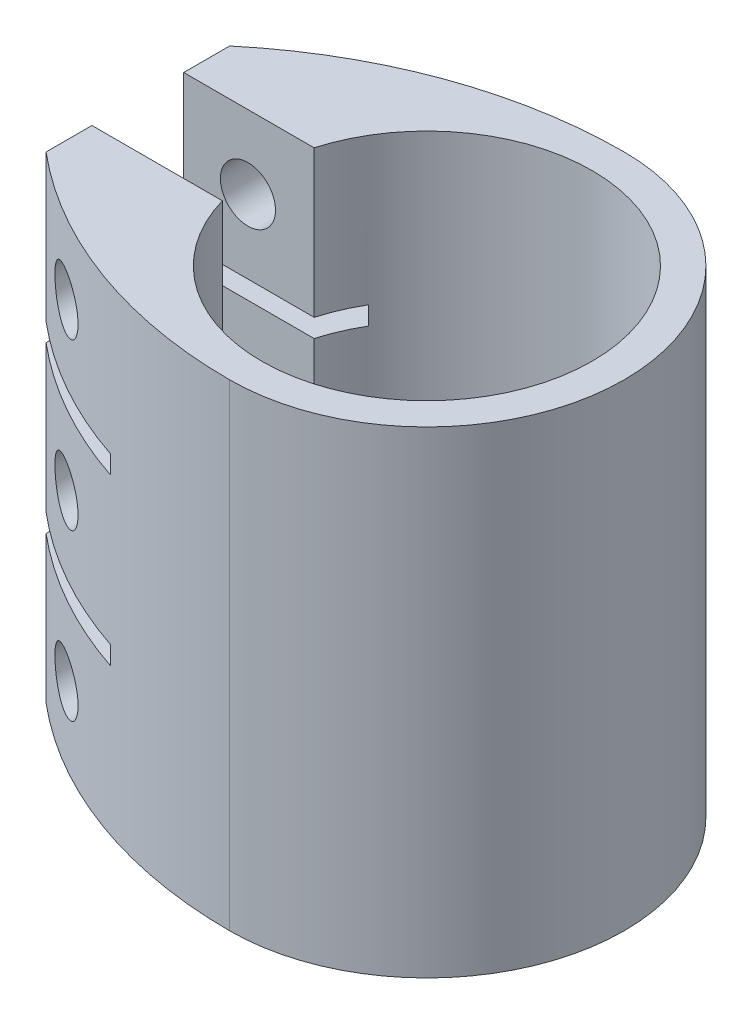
ISO-10303-21;
HEADER;
FILE_DESCRIPTION(('STEP AP214'),'2;1');
FILE_NAME('part.step','',(''),(''),'','','');
FILE_SCHEMA(('AUTOMOTIVE_DESIGN { 1 0 10303 214 1 1 1 1 }'));
ENDSEC;
DATA;
#1=APPLICATION_CONTEXT('core data for automotive mechanical design processes');
#2=APPLICATION_PROTOCOL_DEFINITION('international standard','automotive_design',2000,#1);
#3=PRODUCT_CONTEXT('',#1,'mechanical');
#4=PRODUCT('Part','Part','',(#3));
#5=PRODUCT_RELATED_PRODUCT_CATEGORY('part','',(#4));
#6=PRODUCT_DEFINITION_FORMATION('','',#4);
#7=PRODUCT_DEFINITION_CONTEXT('part definition',#1,'design');
#8=PRODUCT_DEFINITION('design','',#6,#7);
#9=PRODUCT_DEFINITION_SHAPE('','',#8);
#10=(LENGTH_UNIT() NAMED_UNIT(*) SI_UNIT(.MILLI.,.METRE.));
#11=(NAMED_UNIT(*) PLANE_ANGLE_UNIT() SI_UNIT($,.RADIAN.));
#12=(NAMED_UNIT(*) SI_UNIT($,.STERADIAN.) SOLID_ANGLE_UNIT());
#13=UNCERTAINTY_MEASURE_WITH_UNIT(LENGTH_MEASURE(1.E-05),#10,'distance_accuracy_value','');
#14=(GEOMETRIC_REPRESENTATION_CONTEXT(3) GLOBAL_UNCERTAINTY_ASSIGNED_CONTEXT((#13)) GLOBAL_UNIT_ASSIGNED_CONTEXT((#10,
#11,#12)) REPRESENTATION_CONTEXT('',''));
#15=CARTESIAN_POINT('',(0.,0.,0.));
#16=DIRECTION('',(0.,0.,1.));
#17=DIRECTION('',(1.,0.,0.));
#18=AXIS2_PLACEMENT_3D('',#15,#16,#17);
#19=CARTESIAN_POINT('',(0.,52.,27.3913043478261));
#20=DIRECTION('',(0.,-1.,0.));
#21=DIRECTION('',(0.,0.,-1.));
#22=AXIS2_PLACEMENT_3D('',#19,#20,#21);
#23=CYLINDRICAL_SURFACE('',#22,48.8913043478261);
#24=CARTESIAN_POINT('',(0.,16.,27.3913043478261));
#25=DIRECTION('',(0.,1.,0.));
#26=DIRECTION('',(0.,0.,1.));
#27=AXIS2_PLACEMENT_3D('',#24,#25,#26);
#28=CIRCLE('',#27,48.8913043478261);
#29=CARTESIAN_POINT('',(-15.5,16.,-18.9779704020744));
#30=VERTEX_POINT('',#29);
#31=CARTESIAN_POINT('',(-31.5,16.,-9.99999999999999));
#32=VERTEX_POINT('',#31);
#33=EDGE_CURVE('E292',#30,#32,#28,.T.);
#34=ORIENTED_EDGE('',*,*,#33,.F.);
#35=DIRECTION('',(0.,-1.,0.));
#36=VECTOR('',#35,1.);
#37=CARTESIAN_POINT('',(-15.5,52.,-18.9779704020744));
#38=LINE('',#37,#36);
#39=CARTESIAN_POINT('',(-15.5,18.,-18.9779704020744));
#40=VERTEX_POINT('',#39);
#41=EDGE_CURVE('E283',#40,#30,#38,.T.);
#42=ORIENTED_EDGE('',*,*,#41,.F.);
#43=CARTESIAN_POINT('',(0.,18.,27.3913043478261));
#44=DIRECTION('',(0.,-1.,0.));
#45=DIRECTION('',(0.,0.,-1.));
#46=AXIS2_PLACEMENT_3D('',#43,#44,#45);
#47=CIRCLE('',#46,48.8913043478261);
#48=CARTESIAN_POINT('',(-31.5,18.,-9.99999999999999));
#49=VERTEX_POINT('',#48);
#50=EDGE_CURVE('E277',#49,#40,#47,.T.);
#51=ORIENTED_EDGE('',*,*,#50,.F.);
#52=DIRECTION('',(0.,-1.,0.));
#53=VECTOR('',#52,1.);
#54=CARTESIAN_POINT('',(-31.5,52.,-10.));
#55=LINE('',#54,#53);
#56=CARTESIAN_POINT('',(-31.5,34.,-9.99999999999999));
#57=VERTEX_POINT('',#56);
#58=EDGE_CURVE('E368',#57,#49,#55,.T.);
#59=ORIENTED_EDGE('',*,*,#58,.F.);
#60=CARTESIAN_POINT('',(0.,34.,27.3913043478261));
#61=DIRECTION('',(0.,1.,0.));
#62=DIRECTION('',(0.,0.,1.));
#63=AXIS2_PLACEMENT_3D('',#60,#61,#62);
#64=CIRCLE('',#63,48.8913043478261);
#65=CARTESIAN_POINT('',(-15.5,34.,-18.9779704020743));
#66=VERTEX_POINT('',#65);
#67=EDGE_CURVE('E268',#66,#57,#64,.T.);
#68=ORIENTED_EDGE('',*,*,#67,.F.);
#69=DIRECTION('',(0.,-1.,0.));
#70=VECTOR('',#69,1.);
#71=CARTESIAN_POINT('',(-15.5,52.,-18.9779704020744));
#72=LINE('',#71,#70);
#73=CARTESIAN_POINT('',(-15.5,36.,-18.9779704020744));
#74=VERTEX_POINT('',#73);
#75=EDGE_CURVE('E255',#74,#66,#72,.T.);
#76=ORIENTED_EDGE('',*,*,#75,.F.);
#77=CARTESIAN_POINT('',(0.,36.,27.3913043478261));
#78=DIRECTION('',(0.,-1.,0.));
#79=DIRECTION('',(0.,0.,-1.));
#80=AXIS2_PLACEMENT_3D('',#77,#78,#79);
#81=CIRCLE('',#80,48.8913043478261);
#82=CARTESIAN_POINT('',(-31.5,36.,-9.99999999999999));
#83=VERTEX_POINT('',#82);
#84=EDGE_CURVE('E253',#83,#74,#81,.T.);
#85=ORIENTED_EDGE('',*,*,#84,.F.);
#86=CARTESIAN_POINT('',(-31.5,52.,-10.));
#87=VERTEX_POINT('',#86);
#88=EDGE_CURVE('E364',#87,#83,#55,.T.);
#89=ORIENTED_EDGE('',*,*,#88,.F.);
#90=CARTESIAN_POINT('',(0.,52.,27.3913043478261));
#91=DIRECTION('',(0.,1.,0.));
#92=DIRECTION('',(0.,0.,1.));
#93=AXIS2_PLACEMENT_3D('',#90,#91,#92);
#94=CIRCLE('',#93,48.8913043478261);
#95=CARTESIAN_POINT('',(0.,52.,-21.5));
#96=VERTEX_POINT('',#95);
#97=EDGE_CURVE('E295',#96,#87,#94,.T.);
#98=ORIENTED_EDGE('',*,*,#97,.F.);
#99=DIRECTION('',(0.,-1.,0.));
#100=VECTOR('',#99,1.);
#101=CARTESIAN_POINT('',(0.,52.,-21.5));
#102=LINE('',#101,#100);
#103=CARTESIAN_POINT('',(0.,0.,-21.5));
#104=VERTEX_POINT('',#103);
#105=EDGE_CURVE('E313',#96,#104,#102,.T.);
#106=ORIENTED_EDGE('',*,*,#105,.T.);
#107=CARTESIAN_POINT('',(0.,0.,27.3913043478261));
#108=DIRECTION('',(0.,1.,0.));
#109=DIRECTION('',(0.,0.,1.));
#110=AXIS2_PLACEMENT_3D('',#107,#108,#109);
#111=CIRCLE('',#110,48.8913043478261);
#112=CARTESIAN_POINT('',(-31.5,0.,-10.));
#113=VERTEX_POINT('',#112);
#114=EDGE_CURVE('E294',#104,#113,#111,.T.);
#115=ORIENTED_EDGE('',*,*,#114,.T.);
#116=EDGE_CURVE('E362',#32,#113,#55,.T.);
#117=ORIENTED_EDGE('',*,*,#116,.F.);
#118=EDGE_LOOP('',(#34,#42,#51,#59,#68,#76,#85,#89,#98,#106,#115,#117));
#119=FACE_BOUND('',#118,.T.);
#120=CARTESIAN_POINT('',(-27.5,26.,-13.0328176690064));
#121=CARTESIAN_POINT('',(-27.499996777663,26.1482218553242,-13.0328201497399));
#122=CARTESIAN_POINT('',(-27.4889530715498,26.2964691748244,-13.0403394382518));
#123=CARTESIAN_POINT('',(-27.4454526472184,26.588306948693,-13.0698799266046));
#124=CARTESIAN_POINT('',(-27.4129861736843,26.7318952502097,-13.0919077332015));
#125=CARTESIAN_POINT('',(-27.3286540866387,27.0098186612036,-13.1488838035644));
#126=CARTESIAN_POINT('',(-27.2768665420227,27.1441884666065,-13.1837800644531));
#127=CARTESIAN_POINT('',(-27.156332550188,27.4014642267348,-13.2645499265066));
#128=CARTESIAN_POINT('',(-27.0875820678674,27.5243674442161,-13.3104261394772));
#129=CARTESIAN_POINT('',(-26.9304222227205,27.7649678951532,-13.4145955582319));
#130=CARTESIAN_POINT('',(-26.8409766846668,27.8817053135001,-13.4735313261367));
#131=CARTESIAN_POINT('',(-26.6486377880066,28.0986667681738,-13.5992184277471));
#132=CARTESIAN_POINT('',(-26.5457386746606,28.198883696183,-13.6659731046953));
#133=CARTESIAN_POINT('',(-26.3111463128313,28.3973090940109,-13.8167736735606));
#134=CARTESIAN_POINT('',(-26.1775071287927,28.4924331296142,-13.9018518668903));
#135=CARTESIAN_POINT('',(-25.899093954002,28.658734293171,-14.0770412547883));
#136=CARTESIAN_POINT('',(-25.7543129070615,28.7298960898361,-14.1671556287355));
#137=CARTESIAN_POINT('',(-25.4349319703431,28.8564937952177,-14.3635023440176));
#138=CARTESIAN_POINT('',(-25.2590696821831,28.9081022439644,-14.4701629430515));
#139=CARTESIAN_POINT('',(-24.9011712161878,28.978649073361,-14.6840426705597));
#140=CARTESIAN_POINT('',(-24.7191320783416,28.9975715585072,-14.7912620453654));
#141=CARTESIAN_POINT('',(-24.3409319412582,29.002140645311,-15.010695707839));
#142=CARTESIAN_POINT('',(-24.144648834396,28.9854490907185,-15.1227570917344));
#143=CARTESIAN_POINT('',(-23.7558871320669,28.9129556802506,-15.3412014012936));
#144=CARTESIAN_POINT('',(-23.5634085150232,28.857154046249,-15.4475843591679));
#145=CARTESIAN_POINT('',(-23.2865480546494,28.7453583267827,-15.5983102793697));
#146=CARTESIAN_POINT('',(-23.1978216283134,28.7044386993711,-15.6462433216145));
#147=CARTESIAN_POINT('',(-23.0237919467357,28.6135091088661,-15.7395934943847));
#148=CARTESIAN_POINT('',(-22.9384868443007,28.5635041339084,-15.7850119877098));
#149=CARTESIAN_POINT('',(-22.7722214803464,28.4545194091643,-15.8729352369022));
#150=CARTESIAN_POINT('',(-22.6912610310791,28.3955400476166,-15.9154401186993));
#151=CARTESIAN_POINT('',(-22.5347137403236,28.2688713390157,-15.9971054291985));
#152=CARTESIAN_POINT('',(-22.4591234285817,28.2011876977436,-16.0362680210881));
#153=CARTESIAN_POINT('',(-22.322390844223,28.0654863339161,-16.1066927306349));
#154=CARTESIAN_POINT('',(-22.260577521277,27.9983482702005,-16.1383488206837));
#155=CARTESIAN_POINT('',(-22.1427433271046,27.8578857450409,-16.1984069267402));
#156=CARTESIAN_POINT('',(-22.0867190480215,27.7845649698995,-16.2268108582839));
#157=CARTESIAN_POINT('',(-21.9811828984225,27.6322184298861,-16.2800905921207));
#158=CARTESIAN_POINT('',(-21.9316678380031,27.5531954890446,-16.3049681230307));
#159=CARTESIAN_POINT('',(-21.839835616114,27.390072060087,-16.3509390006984));
#160=CARTESIAN_POINT('',(-21.7975175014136,27.3059722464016,-16.3720328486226));
#161=CARTESIAN_POINT('',(-21.6918306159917,27.0684099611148,-16.424558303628));
#162=CARTESIAN_POINT('',(-21.6365290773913,26.9103003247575,-16.4518521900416));
#163=CARTESIAN_POINT('',(-21.5529255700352,26.58554816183,-16.4930124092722));
#164=CARTESIAN_POINT('',(-21.524607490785,26.4189107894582,-16.5068867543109));
#165=CARTESIAN_POINT('',(-21.4975508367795,26.0964506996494,-16.5201421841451));
#166=CARTESIAN_POINT('',(-21.4965837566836,25.9408572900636,-16.5206151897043));
#167=CARTESIAN_POINT('',(-21.5186524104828,25.6318233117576,-16.5098048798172));
#168=CARTESIAN_POINT('',(-21.5416835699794,25.4783823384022,-16.4985238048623));
#169=CARTESIAN_POINT('',(-21.6099877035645,25.181073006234,-16.4649319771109));
#170=CARTESIAN_POINT('',(-21.6548109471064,25.0370752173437,-16.4428441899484));
#171=CARTESIAN_POINT('',(-21.7645967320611,24.7590669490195,-16.3884364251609));
#172=CARTESIAN_POINT('',(-21.829561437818,24.6250575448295,-16.3561153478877));
#173=CARTESIAN_POINT('',(-21.9800151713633,24.3650358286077,-16.2807221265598));
#174=CARTESIAN_POINT('',(-22.0662038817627,24.2395369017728,-16.2372808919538));
#175=CARTESIAN_POINT('',(-22.2544705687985,24.0049455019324,-16.141549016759));
#176=CARTESIAN_POINT('',(-22.356553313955,23.8958579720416,-16.0892557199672));
#177=CARTESIAN_POINT('',(-22.5825898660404,23.6871749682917,-15.9723183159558));
#178=CARTESIAN_POINT('',(-22.7076649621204,23.589173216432,-15.9070023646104));
#179=CARTESIAN_POINT('',(-22.9687473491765,23.415452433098,-15.7690722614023));
#180=CARTESIAN_POINT('',(-23.104759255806,23.3397428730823,-15.6964550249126));
#181=CARTESIAN_POINT('',(-23.3997998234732,23.2037866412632,-15.5370095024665));
#182=CARTESIAN_POINT('',(-23.5596988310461,23.1462275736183,-15.4495008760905));
#183=CARTESIAN_POINT('',(-23.8841884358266,23.0590754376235,-15.2694466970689));
#184=CARTESIAN_POINT('',(-24.0487810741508,23.0294947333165,-15.1768989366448));
#185=CARTESIAN_POINT('',(-24.3970784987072,22.996121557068,-14.978338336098));
#186=CARTESIAN_POINT('',(-24.5808889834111,22.9955332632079,-14.8719662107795));
#187=CARTESIAN_POINT('',(-24.9450199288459,23.0275595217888,-14.6580748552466));
#188=CARTESIAN_POINT('',(-25.1253379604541,23.0601963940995,-14.5505549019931));
#189=CARTESIAN_POINT('',(-25.489493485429,23.1611826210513,-14.3303145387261));
#190=CARTESIAN_POINT('',(-25.6728024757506,23.2317081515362,-14.217708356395));
#191=CARTESIAN_POINT('',(-26.0249148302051,23.4089708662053,-13.9983852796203));
#192=CARTESIAN_POINT('',(-26.1937266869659,23.5156866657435,-13.8916649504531));
#193=CARTESIAN_POINT('',(-26.4808732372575,23.7410308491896,-13.7079227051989));
#194=CARTESIAN_POINT('',(-26.602740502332,23.8536856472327,-13.629081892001));
#195=CARTESIAN_POINT('',(-26.8287290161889,24.1013077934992,-13.4816341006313));
#196=CARTESIAN_POINT('',(-26.9328700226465,24.2362499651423,-13.4130157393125));
#197=CARTESIAN_POINT('',(-27.1048986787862,24.5046786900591,-13.2989053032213));
#198=CARTESIAN_POINT('',(-27.1758793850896,24.6353610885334,-13.2514891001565));
#199=CARTESIAN_POINT('',(-27.2986389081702,24.9091044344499,-13.1691374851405));
#200=CARTESIAN_POINT('',(-27.3504356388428,25.0521536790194,-13.1341904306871));
#201=CARTESIAN_POINT('',(-27.4269135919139,25.3283996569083,-13.0824638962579));
#202=CARTESIAN_POINT('',(-27.454197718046,25.4605505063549,-13.0639443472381));
#203=CARTESIAN_POINT('',(-27.4907410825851,25.7284608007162,-13.039120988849));
#204=CARTESIAN_POINT('',(-27.5000029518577,25.8642197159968,-13.0328153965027));
#205=CARTESIAN_POINT('',(-27.5,26.,-13.0328176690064));
#206=B_SPLINE_CURVE_WITH_KNOTS('',3,(#120,#121,#122,#123,#124,#125,#126,#127,#128,#129,#130,
#131,#132,#133,#134,#135,#136,#137,#138,#139,#140,#141,#142,#143,#144,#145,#146,#147,#148,#149,
#150,#151,#152,#153,#154,#155,#156,#157,#158,#159,#160,#161,#162,#163,#164,#165,#166,#167,#168,
#169,#170,#171,#172,#173,#174,#175,#176,#177,#178,#179,#180,#181,#182,#183,#184,#185,#186,#187,
#188,#189,#190,#191,#192,#193,#194,#195,#196,#197,#198,#199,#200,#201,#202,#203,#204,#205),
.UNSPECIFIED.,.T.,.F.,(4,2,2,2,2,2,2,2,2,2,2,2,2,2,2,2,2,2,2,2,2,2,2,2,2,2,2,2,2,2,2,2,2,2,2,2,
2,2,2,2,2,2,4),(0.,0.444128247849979,0.888458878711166,1.33101325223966,1.77367300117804,
2.24718381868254,2.72089784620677,3.27310665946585,3.82566811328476,4.45912429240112,
5.09288844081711,5.76953457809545,6.44617687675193,6.77229687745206,7.09823836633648,
7.42416575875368,7.74988057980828,8.0392581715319,8.32846443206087,8.61752843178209,
8.9065541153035,9.41269801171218,9.91853952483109,10.3830359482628,10.8474438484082,
11.3026501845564,11.7579054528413,12.2308581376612,12.7039529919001,13.2172396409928,
13.7307440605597,14.3018569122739,14.8732220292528,15.5076061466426,16.1424167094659,
16.8183438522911,17.4938722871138,18.0428920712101,18.5912958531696,19.0576318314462,
19.5235312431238,19.9304392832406,20.3372879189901),.UNSPECIFIED.);
#207=CARTESIAN_POINT('',(-27.5,26.,-13.0328176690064));
#208=VERTEX_POINT('',#207);
#209=EDGE_CURVE('E406',#208,#208,#206,.T.);
#210=ORIENTED_EDGE('',*,*,#209,.F.);
#211=EDGE_LOOP('',(#210));
#212=FACE_BOUND('',#211,.T.);
#213=CARTESIAN_POINT('',(-27.5,44.,-13.0328176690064));
#214=CARTESIAN_POINT('',(-27.499996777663,44.1482218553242,-13.0328201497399));
#215=CARTESIAN_POINT('',(-27.4889530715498,44.2964691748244,-13.0403394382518));
#216=CARTESIAN_POINT('',(-27.4454526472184,44.588306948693,-13.0698799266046));
#217=CARTESIAN_POINT('',(-27.4129861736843,44.7318952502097,-13.0919077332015));
#218=CARTESIAN_POINT('',(-27.3286540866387,45.0098186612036,-13.1488838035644));
#219=CARTESIAN_POINT('',(-27.2768665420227,45.1441884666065,-13.1837800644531));
#220=CARTESIAN_POINT('',(-27.156332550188,45.4014642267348,-13.2645499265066));
#221=CARTESIAN_POINT('',(-27.0875820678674,45.5243674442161,-13.3104261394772));
#222=CARTESIAN_POINT('',(-26.9304222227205,45.7649678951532,-13.4145955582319));
#223=CARTESIAN_POINT('',(-26.8409766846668,45.8817053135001,-13.4735313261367));
#224=CARTESIAN_POINT('',(-26.6486377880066,46.0986667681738,-13.5992184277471));
#225=CARTESIAN_POINT('',(-26.5457386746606,46.198883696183,-13.6659731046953));
#226=CARTESIAN_POINT('',(-26.3111463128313,46.3973090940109,-13.8167736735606));
#227=CARTESIAN_POINT('',(-26.1775071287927,46.4924331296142,-13.9018518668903));
#228=CARTESIAN_POINT('',(-25.899093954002,46.6587342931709,-14.0770412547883));
#229=CARTESIAN_POINT('',(-25.7543129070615,46.7298960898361,-14.1671556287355));
#230=CARTESIAN_POINT('',(-25.4349319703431,46.8564937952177,-14.3635023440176));
#231=CARTESIAN_POINT('',(-25.2590696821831,46.9081022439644,-14.4701629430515));
#232=CARTESIAN_POINT('',(-24.9011712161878,46.978649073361,-14.6840426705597));
#233=CARTESIAN_POINT('',(-24.7191320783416,46.9975715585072,-14.7912620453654));
#234=CARTESIAN_POINT('',(-24.3409319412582,47.002140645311,-15.010695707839));
#235=CARTESIAN_POINT('',(-24.144648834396,46.9854490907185,-15.1227570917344));
#236=CARTESIAN_POINT('',(-23.7558871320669,46.9129556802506,-15.3412014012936));
#237=CARTESIAN_POINT('',(-23.5634085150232,46.857154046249,-15.4475843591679));
#238=CARTESIAN_POINT('',(-23.2865480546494,46.7453583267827,-15.5983102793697));
#239=CARTESIAN_POINT('',(-23.1978216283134,46.7044386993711,-15.6462433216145));
#240=CARTESIAN_POINT('',(-23.0237919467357,46.6135091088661,-15.7395934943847));
#241=CARTESIAN_POINT('',(-22.9384868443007,46.5635041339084,-15.7850119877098));
#242=CARTESIAN_POINT('',(-22.7722214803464,46.4545194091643,-15.8729352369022));
#243=CARTESIAN_POINT('',(-22.6912610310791,46.3955400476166,-15.9154401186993));
#244=CARTESIAN_POINT('',(-22.5347137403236,46.2688713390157,-15.9971054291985));
#245=CARTESIAN_POINT('',(-22.4591234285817,46.2011876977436,-16.0362680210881));
#246=CARTESIAN_POINT('',(-22.322390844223,46.0654863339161,-16.1066927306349));
#247=CARTESIAN_POINT('',(-22.260577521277,45.9983482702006,-16.1383488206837));
#248=CARTESIAN_POINT('',(-22.1427433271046,45.8578857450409,-16.1984069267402));
#249=CARTESIAN_POINT('',(-22.0867190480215,45.7845649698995,-16.2268108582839));
#250=CARTESIAN_POINT('',(-21.9811828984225,45.6322184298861,-16.2800905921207));
#251=CARTESIAN_POINT('',(-21.9316678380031,45.5531954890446,-16.3049681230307));
#252=CARTESIAN_POINT('',(-21.839835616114,45.390072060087,-16.3509390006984));
#253=CARTESIAN_POINT('',(-21.7975175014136,45.3059722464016,-16.3720328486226));
#254=CARTESIAN_POINT('',(-21.6918306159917,45.0684099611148,-16.424558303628));
#255=CARTESIAN_POINT('',(-21.6365290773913,44.9103003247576,-16.4518521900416));
#256=CARTESIAN_POINT('',(-21.5529255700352,44.58554816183,-16.4930124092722));
#257=CARTESIAN_POINT('',(-21.524607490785,44.4189107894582,-16.5068867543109));
#258=CARTESIAN_POINT('',(-21.4975508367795,44.0964506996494,-16.5201421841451));
#259=CARTESIAN_POINT('',(-21.4965837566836,43.9408572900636,-16.5206151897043));
#260=CARTESIAN_POINT('',(-21.5186524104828,43.6318233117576,-16.5098048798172));
#261=CARTESIAN_POINT('',(-21.5416835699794,43.4783823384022,-16.4985238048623));
#262=CARTESIAN_POINT('',(-21.6099877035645,43.181073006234,-16.4649319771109));
#263=CARTESIAN_POINT('',(-21.6548109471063,43.0370752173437,-16.4428441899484));
#264=CARTESIAN_POINT('',(-21.7645967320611,42.7590669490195,-16.3884364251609));
#265=CARTESIAN_POINT('',(-21.829561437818,42.6250575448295,-16.3561153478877));
#266=CARTESIAN_POINT('',(-21.9800151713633,42.3650358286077,-16.2807221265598));
#267=CARTESIAN_POINT('',(-22.0662038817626,42.2395369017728,-16.2372808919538));
#268=CARTESIAN_POINT('',(-22.2544705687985,42.0049455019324,-16.141549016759));
#269=CARTESIAN_POINT('',(-22.356553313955,41.8958579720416,-16.0892557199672));
#270=CARTESIAN_POINT('',(-22.5825898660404,41.6871749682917,-15.9723183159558));
#271=CARTESIAN_POINT('',(-22.7076649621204,41.589173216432,-15.9070023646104));
#272=CARTESIAN_POINT('',(-22.9687473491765,41.415452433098,-15.7690722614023));
#273=CARTESIAN_POINT('',(-23.104759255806,41.3397428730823,-15.6964550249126));
#274=CARTESIAN_POINT('',(-23.3997998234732,41.2037866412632,-15.5370095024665));
#275=CARTESIAN_POINT('',(-23.5596988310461,41.1462275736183,-15.4495008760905));
#276=CARTESIAN_POINT('',(-23.8841884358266,41.0590754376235,-15.2694466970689));
#277=CARTESIAN_POINT('',(-24.0487810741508,41.0294947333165,-15.1768989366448));
#278=CARTESIAN_POINT('',(-24.3970784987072,40.996121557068,-14.978338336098));
#279=CARTESIAN_POINT('',(-24.5808889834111,40.9955332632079,-14.8719662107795));
#280=CARTESIAN_POINT('',(-24.9450199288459,41.0275595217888,-14.6580748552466));
#281=CARTESIAN_POINT('',(-25.1253379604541,41.0601963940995,-14.5505549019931));
#282=CARTESIAN_POINT('',(-25.489493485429,41.1611826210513,-14.3303145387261));
#283=CARTESIAN_POINT('',(-25.6728024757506,41.2317081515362,-14.217708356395));
#284=CARTESIAN_POINT('',(-26.0249148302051,41.4089708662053,-13.9983852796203));
#285=CARTESIAN_POINT('',(-26.1937266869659,41.5156866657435,-13.8916649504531));
#286=CARTESIAN_POINT('',(-26.4808732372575,41.7410308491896,-13.7079227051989));
#287=CARTESIAN_POINT('',(-26.602740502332,41.8536856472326,-13.629081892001));
#288=CARTESIAN_POINT('',(-26.8287290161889,42.1013077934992,-13.4816341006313));
#289=CARTESIAN_POINT('',(-26.9328700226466,42.2362499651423,-13.4130157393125));
#290=CARTESIAN_POINT('',(-27.1048986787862,42.5046786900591,-13.2989053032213));
#291=CARTESIAN_POINT('',(-27.1758793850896,42.6353610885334,-13.2514891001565));
#292=CARTESIAN_POINT('',(-27.2986389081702,42.9091044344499,-13.1691374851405));
#293=CARTESIAN_POINT('',(-27.3504356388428,43.0521536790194,-13.1341904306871));
#294=CARTESIAN_POINT('',(-27.4269135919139,43.3283996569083,-13.0824638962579));
#295=CARTESIAN_POINT('',(-27.4541977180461,43.4605505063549,-13.0639443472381));
#296=CARTESIAN_POINT('',(-27.4907410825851,43.7284608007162,-13.039120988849));
#297=CARTESIAN_POINT('',(-27.5000029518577,43.8642197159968,-13.0328153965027));
#298=CARTESIAN_POINT('',(-27.5,44.,-13.0328176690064));
#299=B_SPLINE_CURVE_WITH_KNOTS('',3,(#213,#214,#215,#216,#217,#218,#219,#220,#221,#222,#223,
#224,#225,#226,#227,#228,#229,#230,#231,#232,#233,#234,#235,#236,#237,#238,#239,#240,#241,#242,
#243,#244,#245,#246,#247,#248,#249,#250,#251,#252,#253,#254,#255,#256,#257,#258,#259,#260,#261,
#262,#263,#264,#265,#266,#267,#268,#269,#270,#271,#272,#273,#274,#275,#276,#277,#278,#279,#280,
#281,#282,#283,#284,#285,#286,#287,#288,#289,#290,#291,#292,#293,#294,#295,#296,#297,#298),
.UNSPECIFIED.,.T.,.F.,(4,2,2,2,2,2,2,2,2,2,2,2,2,2,2,2,2,2,2,2,2,2,2,2,2,2,2,2,2,2,2,2,2,2,2,2,
2,2,2,2,2,2,4),(0.,0.444128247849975,0.888458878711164,1.33101325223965,1.77367300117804,
2.24718381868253,2.72089784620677,3.27310665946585,3.82566811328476,4.45912429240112,
5.09288844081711,5.76953457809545,6.44617687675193,6.77229687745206,7.09823836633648,
7.42416575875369,7.74988057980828,8.0392581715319,8.32846443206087,8.61752843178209,
8.9065541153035,9.41269801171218,9.9185395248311,10.3830359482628,10.8474438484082,
11.3026501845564,11.7579054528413,12.2308581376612,12.7039529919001,13.2172396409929,
13.7307440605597,14.3018569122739,14.8732220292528,15.5076061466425,16.1424167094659,
16.8183438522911,17.4938722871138,18.0428920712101,18.5912958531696,19.0576318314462,
19.5235312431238,19.9304392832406,20.3372879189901),.UNSPECIFIED.);
#300=CARTESIAN_POINT('',(-27.5,44.,-13.0328176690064));
#301=VERTEX_POINT('',#300);
#302=EDGE_CURVE('E421',#301,#301,#299,.T.);
#303=ORIENTED_EDGE('',*,*,#302,.F.);
#304=EDGE_LOOP('',(#303));
#305=FACE_BOUND('',#304,.T.);
#306=CARTESIAN_POINT('',(-27.5,8.,-13.0328176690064));
#307=CARTESIAN_POINT('',(-27.499996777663,8.14822185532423,-13.0328201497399));
#308=CARTESIAN_POINT('',(-27.4889530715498,8.29646917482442,-13.0403394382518));
#309=CARTESIAN_POINT('',(-27.4454526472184,8.58830694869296,-13.0698799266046));
#310=CARTESIAN_POINT('',(-27.4129861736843,8.73189525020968,-13.0919077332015));
#311=CARTESIAN_POINT('',(-27.3286540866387,9.0098186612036,-13.1488838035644));
#312=CARTESIAN_POINT('',(-27.2768665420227,9.14418846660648,-13.1837800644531));
#313=CARTESIAN_POINT('',(-27.156332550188,9.40146422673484,-13.2645499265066));
#314=CARTESIAN_POINT('',(-27.0875820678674,9.52436744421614,-13.3104261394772));
#315=CARTESIAN_POINT('',(-26.9304222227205,9.76496789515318,-13.4145955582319));
#316=CARTESIAN_POINT('',(-26.8409766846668,9.88170531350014,-13.4735313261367));
#317=CARTESIAN_POINT('',(-26.6486377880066,10.0986667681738,-13.5992184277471));
#318=CARTESIAN_POINT('',(-26.5457386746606,10.198883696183,-13.6659731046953));
#319=CARTESIAN_POINT('',(-26.3111463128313,10.3973090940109,-13.8167736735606));
#320=CARTESIAN_POINT('',(-26.1775071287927,10.4924331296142,-13.9018518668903));
#321=CARTESIAN_POINT('',(-25.899093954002,10.658734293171,-14.0770412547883));
#322=CARTESIAN_POINT('',(-25.7543129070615,10.7298960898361,-14.1671556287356));
#323=CARTESIAN_POINT('',(-25.4349319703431,10.8564937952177,-14.3635023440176));
#324=CARTESIAN_POINT('',(-25.2590696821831,10.9081022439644,-14.4701629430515));
#325=CARTESIAN_POINT('',(-24.9011712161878,10.9786490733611,-14.6840426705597));
#326=CARTESIAN_POINT('',(-24.7191320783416,10.9975715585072,-14.7912620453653));
#327=CARTESIAN_POINT('',(-24.3409319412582,11.002140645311,-15.010695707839));
#328=CARTESIAN_POINT('',(-24.144648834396,10.9854490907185,-15.1227570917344));
#329=CARTESIAN_POINT('',(-23.7558871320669,10.9129556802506,-15.3412014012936));
#330=CARTESIAN_POINT('',(-23.5634085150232,10.857154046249,-15.4475843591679));
#331=CARTESIAN_POINT('',(-23.2865480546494,10.7453583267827,-15.5983102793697));
#332=CARTESIAN_POINT('',(-23.1978216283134,10.7044386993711,-15.6462433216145));
#333=CARTESIAN_POINT('',(-23.0237919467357,10.6135091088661,-15.7395934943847));
#334=CARTESIAN_POINT('',(-22.9384868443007,10.5635041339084,-15.7850119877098));
#335=CARTESIAN_POINT('',(-22.7722214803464,10.4545194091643,-15.8729352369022));
#336=CARTESIAN_POINT('',(-22.6912610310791,10.3955400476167,-15.9154401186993));
#337=CARTESIAN_POINT('',(-22.5347137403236,10.2688713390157,-15.9971054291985));
#338=CARTESIAN_POINT('',(-22.4591234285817,10.2011876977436,-16.0362680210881));
#339=CARTESIAN_POINT('',(-22.322390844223,10.0654863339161,-16.1066927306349));
#340=CARTESIAN_POINT('',(-22.260577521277,9.99834827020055,-16.1383488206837));
#341=CARTESIAN_POINT('',(-22.1427433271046,9.85788574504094,-16.1984069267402));
#342=CARTESIAN_POINT('',(-22.0867190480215,9.78456496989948,-16.2268108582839));
#343=CARTESIAN_POINT('',(-21.9811828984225,9.63221842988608,-16.2800905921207));
#344=CARTESIAN_POINT('',(-21.9316678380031,9.55319548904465,-16.3049681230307));
#345=CARTESIAN_POINT('',(-21.839835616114,9.39007206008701,-16.3509390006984));
#346=CARTESIAN_POINT('',(-21.7975175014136,9.30597224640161,-16.3720328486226));
#347=CARTESIAN_POINT('',(-21.6918306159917,9.0684099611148,-16.424558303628));
#348=CARTESIAN_POINT('',(-21.6365290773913,8.91030032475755,-16.4518521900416));
#349=CARTESIAN_POINT('',(-21.5529255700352,8.58554816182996,-16.4930124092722));
#350=CARTESIAN_POINT('',(-21.524607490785,8.41891078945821,-16.5068867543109));
#351=CARTESIAN_POINT('',(-21.4975508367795,8.09645069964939,-16.5201421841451));
#352=CARTESIAN_POINT('',(-21.4965837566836,7.9408572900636,-16.5206151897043));
#353=CARTESIAN_POINT('',(-21.5186524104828,7.63182331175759,-16.5098048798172));
#354=CARTESIAN_POINT('',(-21.5416835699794,7.47838233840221,-16.4985238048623));
#355=CARTESIAN_POINT('',(-21.6099877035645,7.18107300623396,-16.4649319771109));
#356=CARTESIAN_POINT('',(-21.6548109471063,7.03707521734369,-16.4428441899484));
#357=CARTESIAN_POINT('',(-21.7645967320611,6.75906694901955,-16.3884364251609));
#358=CARTESIAN_POINT('',(-21.829561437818,6.62505754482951,-16.3561153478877));
#359=CARTESIAN_POINT('',(-21.9800151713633,6.36503582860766,-16.2807221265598));
#360=CARTESIAN_POINT('',(-22.0662038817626,6.2395369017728,-16.2372808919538));
#361=CARTESIAN_POINT('',(-22.2544705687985,6.00494550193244,-16.141549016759));
#362=CARTESIAN_POINT('',(-22.356553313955,5.89585797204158,-16.0892557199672));
#363=CARTESIAN_POINT('',(-22.5825898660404,5.6871749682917,-15.9723183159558));
#364=CARTESIAN_POINT('',(-22.7076649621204,5.58917321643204,-15.9070023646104));
#365=CARTESIAN_POINT('',(-22.9687473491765,5.41545243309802,-15.7690722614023));
#366=CARTESIAN_POINT('',(-23.104759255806,5.33974287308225,-15.6964550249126));
#367=CARTESIAN_POINT('',(-23.3997998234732,5.20378664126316,-15.5370095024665));
#368=CARTESIAN_POINT('',(-23.5596988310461,5.14622757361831,-15.4495008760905));
#369=CARTESIAN_POINT('',(-23.8841884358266,5.05907543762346,-15.2694466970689));
#370=CARTESIAN_POINT('',(-24.0487810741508,5.02949473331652,-15.1768989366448));
#371=CARTESIAN_POINT('',(-24.3970784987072,4.99612155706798,-14.978338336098));
#372=CARTESIAN_POINT('',(-24.5808889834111,4.99553326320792,-14.8719662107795));
#373=CARTESIAN_POINT('',(-24.9450199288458,5.02755952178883,-14.6580748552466));
#374=CARTESIAN_POINT('',(-25.1253379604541,5.0601963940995,-14.5505549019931));
#375=CARTESIAN_POINT('',(-25.489493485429,5.16118262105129,-14.3303145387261));
#376=CARTESIAN_POINT('',(-25.6728024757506,5.23170815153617,-14.217708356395));
#377=CARTESIAN_POINT('',(-26.0249148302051,5.40897086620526,-13.9983852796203));
#378=CARTESIAN_POINT('',(-26.1937266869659,5.51568666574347,-13.8916649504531));
#379=CARTESIAN_POINT('',(-26.4808732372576,5.74103084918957,-13.7079227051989));
#380=CARTESIAN_POINT('',(-26.602740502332,5.85368564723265,-13.629081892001));
#381=CARTESIAN_POINT('',(-26.8287290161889,6.10130779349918,-13.4816341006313));
#382=CARTESIAN_POINT('',(-26.9328700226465,6.23624996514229,-13.4130157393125));
#383=CARTESIAN_POINT('',(-27.1048986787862,6.50467869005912,-13.2989053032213));
#384=CARTESIAN_POINT('',(-27.1758793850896,6.63536108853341,-13.2514891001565));
#385=CARTESIAN_POINT('',(-27.2986389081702,6.90910443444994,-13.1691374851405));
#386=CARTESIAN_POINT('',(-27.3504356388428,7.05215367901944,-13.1341904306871));
#387=CARTESIAN_POINT('',(-27.4269135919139,7.32839965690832,-13.0824638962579));
#388=CARTESIAN_POINT('',(-27.4541977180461,7.46055050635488,-13.0639443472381));
#389=CARTESIAN_POINT('',(-27.4907410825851,7.7284608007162,-13.039120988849));
#390=CARTESIAN_POINT('',(-27.5000029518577,7.86421971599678,-13.0328153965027));
#391=CARTESIAN_POINT('',(-27.5,8.,-13.0328176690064));
#392=B_SPLINE_CURVE_WITH_KNOTS('',3,(#306,#307,#308,#309,#310,#311,#312,#313,#314,#315,#316,
#317,#318,#319,#320,#321,#322,#323,#324,#325,#326,#327,#328,#329,#330,#331,#332,#333,#334,#335,
#336,#337,#338,#339,#340,#341,#342,#343,#344,#345,#346,#347,#348,#349,#350,#351,#352,#353,#354,
#355,#356,#357,#358,#359,#360,#361,#362,#363,#364,#365,#366,#367,#368,#369,#370,#371,#372,#373,
#374,#375,#376,#377,#378,#379,#380,#381,#382,#383,#384,#385,#386,#387,#388,#389,#390,#391),
.UNSPECIFIED.,.T.,.F.,(4,2,2,2,2,2,2,2,2,2,2,2,2,2,2,2,2,2,2,2,2,2,2,2,2,2,2,2,2,2,2,2,2,2,2,2,
2,2,2,2,2,2,4),(0.,0.444128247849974,0.888458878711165,1.33101325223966,1.77367300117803,
2.24718381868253,2.72089784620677,3.27310665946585,3.82566811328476,4.45912429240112,
5.09288844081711,5.76953457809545,6.44617687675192,6.77229687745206,7.09823836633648,
7.42416575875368,7.74988057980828,8.03925817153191,8.32846443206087,8.61752843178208,
8.9065541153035,9.41269801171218,9.91853952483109,10.3830359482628,10.8474438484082,
11.3026501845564,11.7579054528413,12.2308581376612,12.7039529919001,13.2172396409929,
13.7307440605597,14.3018569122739,14.8732220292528,15.5076061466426,16.1424167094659,
16.8183438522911,17.4938722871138,18.0428920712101,18.5912958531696,19.0576318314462,
19.5235312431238,19.9304392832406,20.3372879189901),.UNSPECIFIED.);
#393=CARTESIAN_POINT('',(-27.5,8.,-13.0328176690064));
#394=VERTEX_POINT('',#393);
#395=EDGE_CURVE('E459',#394,#394,#392,.T.);
#396=ORIENTED_EDGE('',*,*,#395,.F.);
#397=EDGE_LOOP('',(#396));
#398=FACE_BOUND('',#397,.T.);
#399=ADVANCED_FACE('F34',(#119,#212,#305,#398),#23,.T.);
#400=CARTESIAN_POINT('',(0.,52.,-27.3913043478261));
#401=DIRECTION('',(0.,-1.,0.));
#402=DIRECTION('',(0.,0.,-1.));
#403=AXIS2_PLACEMENT_3D('',#400,#401,#402);
#404=CYLINDRICAL_SURFACE('',#403,48.8913043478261);
#405=CARTESIAN_POINT('',(0.,16.,-27.3913043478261));
#406=DIRECTION('',(0.,1.,0.));
#407=DIRECTION('',(0.,0.,1.));
#408=AXIS2_PLACEMENT_3D('',#405,#406,#407);
#409=CIRCLE('',#408,48.8913043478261);
#410=CARTESIAN_POINT('',(-31.5,16.,10.));
#411=VERTEX_POINT('',#410);
#412=CARTESIAN_POINT('',(-15.5,16.,18.9779704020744));
#413=VERTEX_POINT('',#412);
#414=EDGE_CURVE('E11',#411,#413,#409,.T.);
#415=ORIENTED_EDGE('',*,*,#414,.F.);
#416=DIRECTION('',(0.,-1.,0.));
#417=VECTOR('',#416,1.);
#418=CARTESIAN_POINT('',(-31.5,52.,10.));
#419=LINE('',#418,#417);
#420=CARTESIAN_POINT('',(-31.5,0.,10.));
#421=VERTEX_POINT('',#420);
#422=EDGE_CURVE('E339',#411,#421,#419,.T.);
#423=ORIENTED_EDGE('',*,*,#422,.T.);
#424=CARTESIAN_POINT('',(0.,0.,-27.3913043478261));
#425=DIRECTION('',(0.,1.,0.));
#426=DIRECTION('',(0.,0.,-1.));
#427=AXIS2_PLACEMENT_3D('',#424,#425,#426);
#428=CIRCLE('',#427,48.8913043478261);
#429=CARTESIAN_POINT('',(0.,0.,21.5));
#430=VERTEX_POINT('',#429);
#431=EDGE_CURVE('E331',#421,#430,#428,.T.);
#432=ORIENTED_EDGE('',*,*,#431,.T.);
#433=DIRECTION('',(0.,-1.,0.));
#434=VECTOR('',#433,1.);
#435=CARTESIAN_POINT('',(0.,52.,21.5));
#436=LINE('',#435,#434);
#437=CARTESIAN_POINT('',(0.,52.,21.5));
#438=VERTEX_POINT('',#437);
#439=EDGE_CURVE('E336',#438,#430,#436,.T.);
#440=ORIENTED_EDGE('',*,*,#439,.F.);
#441=CARTESIAN_POINT('',(0.,52.,-27.3913043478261));
#442=DIRECTION('',(0.,1.,0.));
#443=DIRECTION('',(0.,0.,-1.));
#444=AXIS2_PLACEMENT_3D('',#441,#442,#443);
#445=CIRCLE('',#444,48.8913043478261);
#446=CARTESIAN_POINT('',(-31.5,52.,10.));
#447=VERTEX_POINT('',#446);
#448=EDGE_CURVE('E309',#447,#438,#445,.T.);
#449=ORIENTED_EDGE('',*,*,#448,.F.);
#450=CARTESIAN_POINT('',(-31.5,36.,10.));
#451=VERTEX_POINT('',#450);
#452=EDGE_CURVE('E340',#447,#451,#419,.T.);
#453=ORIENTED_EDGE('',*,*,#452,.T.);
#454=CARTESIAN_POINT('',(0.,36.,-27.3913043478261));
#455=DIRECTION('',(0.,-1.,0.));
#456=DIRECTION('',(0.,0.,-1.));
#457=AXIS2_PLACEMENT_3D('',#454,#455,#456);
#458=CIRCLE('',#457,48.8913043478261);
#459=CARTESIAN_POINT('',(-15.5,36.,18.9779704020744));
#460=VERTEX_POINT('',#459);
#461=EDGE_CURVE('E367',#460,#451,#458,.T.);
#462=ORIENTED_EDGE('',*,*,#461,.F.);
#463=DIRECTION('',(0.,-1.,0.));
#464=VECTOR('',#463,1.);
#465=CARTESIAN_POINT('',(-15.5,52.,18.9779704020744));
#466=LINE('',#465,#464);
#467=CARTESIAN_POINT('',(-15.5,34.,18.9779704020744));
#468=VERTEX_POINT('',#467);
#469=EDGE_CURVE('E243',#468,#460,#466,.F.);
#470=ORIENTED_EDGE('',*,*,#469,.F.);
#471=CARTESIAN_POINT('',(0.,34.,-27.3913043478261));
#472=DIRECTION('',(0.,1.,0.));
#473=DIRECTION('',(0.,0.,1.));
#474=AXIS2_PLACEMENT_3D('',#471,#472,#473);
#475=CIRCLE('',#474,48.8913043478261);
#476=CARTESIAN_POINT('',(-31.5,34.,10.));
#477=VERTEX_POINT('',#476);
#478=EDGE_CURVE('E371',#477,#468,#475,.T.);
#479=ORIENTED_EDGE('',*,*,#478,.F.);
#480=CARTESIAN_POINT('',(-31.5,18.,10.));
#481=VERTEX_POINT('',#480);
#482=EDGE_CURVE('E344',#477,#481,#419,.T.);
#483=ORIENTED_EDGE('',*,*,#482,.T.);
#484=CARTESIAN_POINT('',(0.,18.,-27.3913043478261));
#485=DIRECTION('',(0.,-1.,0.));
#486=DIRECTION('',(0.,0.,-1.));
#487=AXIS2_PLACEMENT_3D('',#484,#485,#486);
#488=CIRCLE('',#487,48.8913043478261);
#489=CARTESIAN_POINT('',(-15.5,18.,18.9779704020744));
#490=VERTEX_POINT('',#489);
#491=EDGE_CURVE('E373',#490,#481,#488,.T.);
#492=ORIENTED_EDGE('',*,*,#491,.F.);
#493=DIRECTION('',(0.,-1.,0.));
#494=VECTOR('',#493,1.);
#495=CARTESIAN_POINT('',(-15.5,52.,18.9779704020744));
#496=LINE('',#495,#494);
#497=EDGE_CURVE('E48',#413,#490,#496,.F.);
#498=ORIENTED_EDGE('',*,*,#497,.F.);
#499=EDGE_LOOP('',(#415,#423,#432,#440,#449,#453,#462,#470,#479,#483,#492,#498));
#500=FACE_BOUND('',#499,.T.);
#501=CARTESIAN_POINT('',(-27.5,26.,13.0328176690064));
#502=CARTESIAN_POINT('',(-27.499996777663,25.8517781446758,13.0328201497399));
#503=CARTESIAN_POINT('',(-27.4889530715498,25.7035308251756,13.0403394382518));
#504=CARTESIAN_POINT('',(-27.4454526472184,25.411693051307,13.0698799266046));
#505=CARTESIAN_POINT('',(-27.4129861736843,25.2681047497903,13.0919077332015));
#506=CARTESIAN_POINT('',(-27.3286540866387,24.9901813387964,13.1488838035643));
#507=CARTESIAN_POINT('',(-27.2768665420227,24.8558115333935,13.1837800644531));
#508=CARTESIAN_POINT('',(-27.156332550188,24.5985357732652,13.2645499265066));
#509=CARTESIAN_POINT('',(-27.0875820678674,24.4756325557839,13.3104261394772));
#510=CARTESIAN_POINT('',(-26.9304222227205,24.2350321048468,13.4145955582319));
#511=CARTESIAN_POINT('',(-26.8409766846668,24.1182946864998,13.4735313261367));
#512=CARTESIAN_POINT('',(-26.6486377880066,23.9013332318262,13.5992184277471));
#513=CARTESIAN_POINT('',(-26.5457386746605,23.801116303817,13.6659731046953));
#514=CARTESIAN_POINT('',(-26.3111463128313,23.6026909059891,13.8167736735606));
#515=CARTESIAN_POINT('',(-26.1775071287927,23.5075668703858,13.9018518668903));
#516=CARTESIAN_POINT('',(-25.899093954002,23.341265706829,14.0770412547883));
#517=CARTESIAN_POINT('',(-25.7543129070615,23.2701039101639,14.1671556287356));
#518=CARTESIAN_POINT('',(-25.4349319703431,23.1435062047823,14.3635023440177));
#519=CARTESIAN_POINT('',(-25.2590696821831,23.0918977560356,14.4701629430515));
#520=CARTESIAN_POINT('',(-24.9011712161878,23.0213509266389,14.6840426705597));
#521=CARTESIAN_POINT('',(-24.7191320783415,23.0024284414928,14.7912620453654));
#522=CARTESIAN_POINT('',(-24.3409319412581,22.997859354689,15.0106957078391));
#523=CARTESIAN_POINT('',(-24.144648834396,23.0145509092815,15.1227570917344));
#524=CARTESIAN_POINT('',(-23.7558871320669,23.0870443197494,15.3412014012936));
#525=CARTESIAN_POINT('',(-23.5634085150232,23.142845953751,15.4475843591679));
#526=CARTESIAN_POINT('',(-23.2865480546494,23.2546416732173,15.5983102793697));
#527=CARTESIAN_POINT('',(-23.1978216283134,23.2955613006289,15.6462433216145));
#528=CARTESIAN_POINT('',(-23.0237919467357,23.3864908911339,15.7395934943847));
#529=CARTESIAN_POINT('',(-22.9384868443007,23.4364958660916,15.7850119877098));
#530=CARTESIAN_POINT('',(-22.7722214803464,23.5454805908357,15.8729352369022));
#531=CARTESIAN_POINT('',(-22.6912610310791,23.6044599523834,15.9154401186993));
#532=CARTESIAN_POINT('',(-22.5347137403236,23.7311286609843,15.9971054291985));
#533=CARTESIAN_POINT('',(-22.4591234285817,23.7988123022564,16.0362680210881));
#534=CARTESIAN_POINT('',(-22.322390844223,23.9345136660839,16.106692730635));
#535=CARTESIAN_POINT('',(-22.260577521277,24.0016517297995,16.1383488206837));
#536=CARTESIAN_POINT('',(-22.1427433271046,24.1421142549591,16.1984069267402));
#537=CARTESIAN_POINT('',(-22.0867190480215,24.2154350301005,16.2268108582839));
#538=CARTESIAN_POINT('',(-21.9811828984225,24.3677815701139,16.2800905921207));
#539=CARTESIAN_POINT('',(-21.9316678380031,24.4468045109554,16.3049681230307));
#540=CARTESIAN_POINT('',(-21.839835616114,24.609927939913,16.3509390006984));
#541=CARTESIAN_POINT('',(-21.7975175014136,24.6940277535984,16.3720328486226));
#542=CARTESIAN_POINT('',(-21.6918306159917,24.9315900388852,16.424558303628));
#543=CARTESIAN_POINT('',(-21.6365290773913,25.0896996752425,16.4518521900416));
#544=CARTESIAN_POINT('',(-21.5529255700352,25.41445183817,16.4930124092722));
#545=CARTESIAN_POINT('',(-21.524607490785,25.5810892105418,16.5068867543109));
#546=CARTESIAN_POINT('',(-21.4975508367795,25.9035493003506,16.5201421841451));
#547=CARTESIAN_POINT('',(-21.4965837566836,26.0591427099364,16.5206151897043));
#548=CARTESIAN_POINT('',(-21.5186524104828,26.3681766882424,16.5098048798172));
#549=CARTESIAN_POINT('',(-21.5416835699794,26.5216176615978,16.4985238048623));
#550=CARTESIAN_POINT('',(-21.6099877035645,26.818926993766,16.4649319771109));
#551=CARTESIAN_POINT('',(-21.6548109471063,26.9629247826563,16.4428441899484));
#552=CARTESIAN_POINT('',(-21.7645967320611,27.2409330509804,16.3884364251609));
#553=CARTESIAN_POINT('',(-21.829561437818,27.3749424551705,16.3561153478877));
#554=CARTESIAN_POINT('',(-21.9800151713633,27.6349641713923,16.2807221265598));
#555=CARTESIAN_POINT('',(-22.0662038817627,27.7604630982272,16.2372808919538));
#556=CARTESIAN_POINT('',(-22.2544705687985,27.9950544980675,16.141549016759));
#557=CARTESIAN_POINT('',(-22.356553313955,28.1041420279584,16.0892557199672));
#558=CARTESIAN_POINT('',(-22.5825898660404,28.3128250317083,15.9723183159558));
#559=CARTESIAN_POINT('',(-22.7076649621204,28.410826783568,15.9070023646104));
#560=CARTESIAN_POINT('',(-22.9687473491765,28.584547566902,15.7690722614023));
#561=CARTESIAN_POINT('',(-23.1047592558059,28.6602571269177,15.6964550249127));
#562=CARTESIAN_POINT('',(-23.3997998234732,28.7962133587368,15.5370095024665));
#563=CARTESIAN_POINT('',(-23.5596988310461,28.8537724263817,15.4495008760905));
#564=CARTESIAN_POINT('',(-23.8841884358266,28.9409245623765,15.2694466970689));
#565=CARTESIAN_POINT('',(-24.0487810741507,28.9705052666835,15.1768989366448));
#566=CARTESIAN_POINT('',(-24.3970784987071,29.003878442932,14.9783383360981));
#567=CARTESIAN_POINT('',(-24.5808889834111,29.0044667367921,14.8719662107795));
#568=CARTESIAN_POINT('',(-24.9450199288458,28.9724404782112,14.6580748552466));
#569=CARTESIAN_POINT('',(-25.125337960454,28.9398036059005,14.5505549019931));
#570=CARTESIAN_POINT('',(-25.489493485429,28.8388173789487,14.3303145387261));
#571=CARTESIAN_POINT('',(-25.6728024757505,28.7682918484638,14.217708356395));
#572=CARTESIAN_POINT('',(-26.0249148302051,28.5910291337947,13.9983852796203));
#573=CARTESIAN_POINT('',(-26.1937266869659,28.4843133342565,13.8916649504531));
#574=CARTESIAN_POINT('',(-26.4808732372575,28.2589691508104,13.7079227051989));
#575=CARTESIAN_POINT('',(-26.602740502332,28.1463143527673,13.629081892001));
#576=CARTESIAN_POINT('',(-26.8287290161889,27.8986922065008,13.4816341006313));
#577=CARTESIAN_POINT('',(-26.9328700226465,27.7637500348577,13.4130157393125));
#578=CARTESIAN_POINT('',(-27.1048986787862,27.4953213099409,13.2989053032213));
#579=CARTESIAN_POINT('',(-27.1758793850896,27.3646389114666,13.2514891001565));
#580=CARTESIAN_POINT('',(-27.2986389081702,27.0908955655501,13.1691374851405));
#581=CARTESIAN_POINT('',(-27.3504356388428,26.9478463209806,13.1341904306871));
#582=CARTESIAN_POINT('',(-27.4269135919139,26.6716003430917,13.0824638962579));
#583=CARTESIAN_POINT('',(-27.454197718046,26.5394494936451,13.0639443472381));
#584=CARTESIAN_POINT('',(-27.4907410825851,26.2715391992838,13.039120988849));
#585=CARTESIAN_POINT('',(-27.5000029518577,26.1357802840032,13.0328153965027));
#586=CARTESIAN_POINT('',(-27.5,26.,13.0328176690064));
#587=B_SPLINE_CURVE_WITH_KNOTS('',3,(#501,#502,#503,#504,#505,#506,#507,#508,#509,#510,#511,
#512,#513,#514,#515,#516,#517,#518,#519,#520,#521,#522,#523,#524,#525,#526,#527,#528,#529,#530,
#531,#532,#533,#534,#535,#536,#537,#538,#539,#540,#541,#542,#543,#544,#545,#546,#547,#548,#549,
#550,#551,#552,#553,#554,#555,#556,#557,#558,#559,#560,#561,#562,#563,#564,#565,#566,#567,#568,
#569,#570,#571,#572,#573,#574,#575,#576,#577,#578,#579,#580,#581,#582,#583,#584,#585,#586),
.UNSPECIFIED.,.T.,.F.,(4,2,2,2,2,2,2,2,2,2,2,2,2,2,2,2,2,2,2,2,2,2,2,2,2,2,2,2,2,2,2,2,2,2,2,2,
2,2,2,2,2,2,4),(0.,0.444128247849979,0.88845887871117,1.33101325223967,1.77367300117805,
2.24718381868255,2.72089784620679,3.27310665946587,3.82566811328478,4.45912429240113,
5.09288844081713,5.76953457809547,6.44617687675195,6.77229687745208,7.0982383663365,
7.42416575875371,7.74988057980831,8.03925817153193,8.32846443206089,8.61752843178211,
8.90655411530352,9.4126980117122,9.9185395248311,10.3830359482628,10.8474438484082,
11.3026501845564,11.7579054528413,12.2308581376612,12.7039529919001,13.2172396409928,
13.7307440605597,14.3018569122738,14.8732220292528,15.5076061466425,16.1424167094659,
16.818343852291,17.4938722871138,18.0428920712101,18.5912958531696,19.0576318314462,
19.5235312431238,19.9304392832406,20.3372879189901),.UNSPECIFIED.);
#588=CARTESIAN_POINT('',(-27.5,26.,13.0328176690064));
#589=VERTEX_POINT('',#588);
#590=EDGE_CURVE('E377',#589,#589,#587,.T.);
#591=ORIENTED_EDGE('',*,*,#590,.F.);
#592=EDGE_LOOP('',(#591));
#593=FACE_BOUND('',#592,.T.);
#594=CARTESIAN_POINT('',(-27.5,44.,13.0328176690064));
#595=CARTESIAN_POINT('',(-27.499996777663,43.8517781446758,13.0328201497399));
#596=CARTESIAN_POINT('',(-27.4889530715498,43.7035308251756,13.0403394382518));
#597=CARTESIAN_POINT('',(-27.4454526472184,43.411693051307,13.0698799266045));
#598=CARTESIAN_POINT('',(-27.4129861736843,43.2681047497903,13.0919077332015));
#599=CARTESIAN_POINT('',(-27.3286540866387,42.9901813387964,13.1488838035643));
#600=CARTESIAN_POINT('',(-27.2768665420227,42.8558115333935,13.1837800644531));
#601=CARTESIAN_POINT('',(-27.156332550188,42.5985357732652,13.2645499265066));
#602=CARTESIAN_POINT('',(-27.0875820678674,42.4756325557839,13.3104261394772));
#603=CARTESIAN_POINT('',(-26.9304222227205,42.2350321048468,13.4145955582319));
#604=CARTESIAN_POINT('',(-26.8409766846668,42.1182946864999,13.4735313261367));
#605=CARTESIAN_POINT('',(-26.6486377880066,41.9013332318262,13.5992184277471));
#606=CARTESIAN_POINT('',(-26.5457386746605,41.801116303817,13.6659731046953));
#607=CARTESIAN_POINT('',(-26.3111463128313,41.602690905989,13.8167736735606));
#608=CARTESIAN_POINT('',(-26.1775071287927,41.5075668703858,13.9018518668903));
#609=CARTESIAN_POINT('',(-25.899093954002,41.341265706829,14.0770412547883));
#610=CARTESIAN_POINT('',(-25.7543129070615,41.2701039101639,14.1671556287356));
#611=CARTESIAN_POINT('',(-25.4349319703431,41.1435062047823,14.3635023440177));
#612=CARTESIAN_POINT('',(-25.2590696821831,41.0918977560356,14.4701629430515));
#613=CARTESIAN_POINT('',(-24.9011712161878,41.0213509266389,14.6840426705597));
#614=CARTESIAN_POINT('',(-24.7191320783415,41.0024284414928,14.7912620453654));
#615=CARTESIAN_POINT('',(-24.3409319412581,40.997859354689,15.0106957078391));
#616=CARTESIAN_POINT('',(-24.144648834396,41.0145509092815,15.1227570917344));
#617=CARTESIAN_POINT('',(-23.7558871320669,41.0870443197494,15.3412014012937));
#618=CARTESIAN_POINT('',(-23.5634085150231,41.142845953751,15.4475843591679));
#619=CARTESIAN_POINT('',(-23.2865480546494,41.2546416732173,15.5983102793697));
#620=CARTESIAN_POINT('',(-23.1978216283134,41.2955613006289,15.6462433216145));
#621=CARTESIAN_POINT('',(-23.0237919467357,41.3864908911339,15.7395934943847));
#622=CARTESIAN_POINT('',(-22.9384868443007,41.4364958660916,15.7850119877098));
#623=CARTESIAN_POINT('',(-22.7722214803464,41.5454805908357,15.8729352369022));
#624=CARTESIAN_POINT('',(-22.6912610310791,41.6044599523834,15.9154401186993));
#625=CARTESIAN_POINT('',(-22.5347137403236,41.7311286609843,15.9971054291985));
#626=CARTESIAN_POINT('',(-22.4591234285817,41.7988123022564,16.0362680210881));
#627=CARTESIAN_POINT('',(-22.322390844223,41.934513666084,16.106692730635));
#628=CARTESIAN_POINT('',(-22.260577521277,42.0016517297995,16.1383488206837));
#629=CARTESIAN_POINT('',(-22.1427433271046,42.1421142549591,16.1984069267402));
#630=CARTESIAN_POINT('',(-22.0867190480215,42.2154350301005,16.2268108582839));
#631=CARTESIAN_POINT('',(-21.9811828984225,42.3677815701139,16.2800905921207));
#632=CARTESIAN_POINT('',(-21.9316678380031,42.4468045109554,16.3049681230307));
#633=CARTESIAN_POINT('',(-21.839835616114,42.609927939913,16.3509390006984));
#634=CARTESIAN_POINT('',(-21.7975175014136,42.6940277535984,16.3720328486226));
#635=CARTESIAN_POINT('',(-21.6918306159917,42.9315900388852,16.424558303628));
#636=CARTESIAN_POINT('',(-21.6365290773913,43.0896996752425,16.4518521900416));
#637=CARTESIAN_POINT('',(-21.5529255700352,43.41445183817,16.4930124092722));
#638=CARTESIAN_POINT('',(-21.524607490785,43.5810892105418,16.5068867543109));
#639=CARTESIAN_POINT('',(-21.4975508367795,43.9035493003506,16.5201421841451));
#640=CARTESIAN_POINT('',(-21.4965837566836,44.0591427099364,16.5206151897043));
#641=CARTESIAN_POINT('',(-21.5186524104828,44.3681766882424,16.5098048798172));
#642=CARTESIAN_POINT('',(-21.5416835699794,44.5216176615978,16.4985238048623));
#643=CARTESIAN_POINT('',(-21.6099877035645,44.818926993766,16.4649319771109));
#644=CARTESIAN_POINT('',(-21.6548109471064,44.9629247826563,16.4428441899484));
#645=CARTESIAN_POINT('',(-21.7645967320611,45.2409330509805,16.3884364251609));
#646=CARTESIAN_POINT('',(-21.829561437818,45.3749424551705,16.3561153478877));
#647=CARTESIAN_POINT('',(-21.9800151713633,45.6349641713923,16.2807221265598));
#648=CARTESIAN_POINT('',(-22.0662038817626,45.7604630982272,16.2372808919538));
#649=CARTESIAN_POINT('',(-22.2544705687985,45.9950544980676,16.141549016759));
#650=CARTESIAN_POINT('',(-22.356553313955,46.1041420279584,16.0892557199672));
#651=CARTESIAN_POINT('',(-22.5825898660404,46.3128250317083,15.9723183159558));
#652=CARTESIAN_POINT('',(-22.7076649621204,46.410826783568,15.9070023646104));
#653=CARTESIAN_POINT('',(-22.9687473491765,46.584547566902,15.7690722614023));
#654=CARTESIAN_POINT('',(-23.1047592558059,46.6602571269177,15.6964550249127));
#655=CARTESIAN_POINT('',(-23.3997998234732,46.7962133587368,15.5370095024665));
#656=CARTESIAN_POINT('',(-23.5596988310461,46.8537724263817,15.4495008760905));
#657=CARTESIAN_POINT('',(-23.8841884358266,46.9409245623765,15.2694466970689));
#658=CARTESIAN_POINT('',(-24.0487810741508,46.9705052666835,15.1768989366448));
#659=CARTESIAN_POINT('',(-24.3970784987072,47.003878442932,14.9783383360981));
#660=CARTESIAN_POINT('',(-24.5808889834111,47.0044667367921,14.8719662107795));
#661=CARTESIAN_POINT('',(-24.9450199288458,46.9724404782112,14.6580748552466));
#662=CARTESIAN_POINT('',(-25.125337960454,46.9398036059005,14.5505549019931));
#663=CARTESIAN_POINT('',(-25.489493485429,46.8388173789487,14.3303145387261));
#664=CARTESIAN_POINT('',(-25.6728024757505,46.7682918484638,14.217708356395));
#665=CARTESIAN_POINT('',(-26.0249148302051,46.5910291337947,13.9983852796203));
#666=CARTESIAN_POINT('',(-26.1937266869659,46.4843133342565,13.8916649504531));
#667=CARTESIAN_POINT('',(-26.4808732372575,46.2589691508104,13.7079227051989));
#668=CARTESIAN_POINT('',(-26.602740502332,46.1463143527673,13.629081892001));
#669=CARTESIAN_POINT('',(-26.8287290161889,45.8986922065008,13.4816341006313));
#670=CARTESIAN_POINT('',(-26.9328700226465,45.7637500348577,13.4130157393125));
#671=CARTESIAN_POINT('',(-27.1048986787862,45.4953213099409,13.2989053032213));
#672=CARTESIAN_POINT('',(-27.1758793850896,45.3646389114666,13.2514891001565));
#673=CARTESIAN_POINT('',(-27.2986389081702,45.0908955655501,13.1691374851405));
#674=CARTESIAN_POINT('',(-27.3504356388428,44.9478463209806,13.1341904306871));
#675=CARTESIAN_POINT('',(-27.4269135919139,44.6716003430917,13.0824638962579));
#676=CARTESIAN_POINT('',(-27.4541977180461,44.5394494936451,13.0639443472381));
#677=CARTESIAN_POINT('',(-27.4907410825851,44.2715391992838,13.039120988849));
#678=CARTESIAN_POINT('',(-27.5000029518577,44.1357802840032,13.0328153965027));
#679=CARTESIAN_POINT('',(-27.5,44.,13.0328176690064));
#680=B_SPLINE_CURVE_WITH_KNOTS('',3,(#594,#595,#596,#597,#598,#599,#600,#601,#602,#603,#604,
#605,#606,#607,#608,#609,#610,#611,#612,#613,#614,#615,#616,#617,#618,#619,#620,#621,#622,#623,
#624,#625,#626,#627,#628,#629,#630,#631,#632,#633,#634,#635,#636,#637,#638,#639,#640,#641,#642,
#643,#644,#645,#646,#647,#648,#649,#650,#651,#652,#653,#654,#655,#656,#657,#658,#659,#660,#661,
#662,#663,#664,#665,#666,#667,#668,#669,#670,#671,#672,#673,#674,#675,#676,#677,#678,#679),
.UNSPECIFIED.,.T.,.F.,(4,2,2,2,2,2,2,2,2,2,2,2,2,2,2,2,2,2,2,2,2,2,2,2,2,2,2,2,2,2,2,2,2,2,2,2,
2,2,2,2,2,2,4),(0.,0.444128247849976,0.88845887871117,1.33101325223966,1.77367300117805,
2.24718381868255,2.72089784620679,3.27310665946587,3.82566811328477,4.45912429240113,
5.09288844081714,5.76953457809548,6.44617687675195,6.77229687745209,7.09823836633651,
7.42416575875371,7.74988057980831,8.03925817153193,8.32846443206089,8.61752843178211,
8.90655411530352,9.4126980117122,9.91853952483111,10.3830359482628,10.8474438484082,
11.3026501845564,11.7579054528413,12.2308581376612,12.7039529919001,13.2172396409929,
13.7307440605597,14.3018569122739,14.8732220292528,15.5076061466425,16.1424167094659,
16.818343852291,17.4938722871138,18.0428920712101,18.5912958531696,19.0576318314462,
19.5235312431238,19.9304392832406,20.3372879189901),.UNSPECIFIED.);
#681=CARTESIAN_POINT('',(-27.5,44.,13.0328176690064));
#682=VERTEX_POINT('',#681);
#683=EDGE_CURVE('E384',#682,#682,#680,.T.);
#684=ORIENTED_EDGE('',*,*,#683,.F.);
#685=EDGE_LOOP('',(#684));
#686=FACE_BOUND('',#685,.T.);
#687=CARTESIAN_POINT('',(-27.5,8.,13.0328176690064));
#688=CARTESIAN_POINT('',(-27.499996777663,7.85177814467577,13.0328201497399));
#689=CARTESIAN_POINT('',(-27.4889530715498,7.70353082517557,13.0403394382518));
#690=CARTESIAN_POINT('',(-27.4454526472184,7.41169305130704,13.0698799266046));
#691=CARTESIAN_POINT('',(-27.4129861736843,7.26810474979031,13.0919077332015));
#692=CARTESIAN_POINT('',(-27.3286540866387,6.99018133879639,13.1488838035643));
#693=CARTESIAN_POINT('',(-27.2768665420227,6.85581153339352,13.1837800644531));
#694=CARTESIAN_POINT('',(-27.156332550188,6.59853577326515,13.2645499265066));
#695=CARTESIAN_POINT('',(-27.0875820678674,6.47563255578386,13.3104261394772));
#696=CARTESIAN_POINT('',(-26.9304222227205,6.23503210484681,13.4145955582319));
#697=CARTESIAN_POINT('',(-26.8409766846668,6.11829468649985,13.4735313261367));
#698=CARTESIAN_POINT('',(-26.6486377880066,5.90133323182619,13.5992184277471));
#699=CARTESIAN_POINT('',(-26.5457386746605,5.80111630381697,13.6659731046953));
#700=CARTESIAN_POINT('',(-26.3111463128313,5.60269090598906,13.8167736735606));
#701=CARTESIAN_POINT('',(-26.1775071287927,5.50756687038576,13.9018518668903));
#702=CARTESIAN_POINT('',(-25.899093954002,5.34126570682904,14.0770412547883));
#703=CARTESIAN_POINT('',(-25.7543129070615,5.27010391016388,14.1671556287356));
#704=CARTESIAN_POINT('',(-25.4349319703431,5.14350620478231,14.3635023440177));
#705=CARTESIAN_POINT('',(-25.2590696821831,5.0918977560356,14.4701629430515));
#706=CARTESIAN_POINT('',(-24.9011712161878,5.02135092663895,14.6840426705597));
#707=CARTESIAN_POINT('',(-24.7191320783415,5.00242844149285,14.7912620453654));
#708=CARTESIAN_POINT('',(-24.3409319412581,4.997859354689,15.0106957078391));
#709=CARTESIAN_POINT('',(-24.144648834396,5.01455090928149,15.1227570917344));
#710=CARTESIAN_POINT('',(-23.7558871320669,5.08704431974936,15.3412014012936));
#711=CARTESIAN_POINT('',(-23.5634085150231,5.14284595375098,15.4475843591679));
#712=CARTESIAN_POINT('',(-23.2865480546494,5.25464167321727,15.5983102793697));
#713=CARTESIAN_POINT('',(-23.1978216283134,5.29556130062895,15.6462433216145));
#714=CARTESIAN_POINT('',(-23.0237919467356,5.38649089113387,15.7395934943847));
#715=CARTESIAN_POINT('',(-22.9384868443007,5.43649586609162,15.7850119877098));
#716=CARTESIAN_POINT('',(-22.7722214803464,5.54548059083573,15.8729352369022));
#717=CARTESIAN_POINT('',(-22.6912610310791,5.60445995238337,15.9154401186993));
#718=CARTESIAN_POINT('',(-22.5347137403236,5.73112866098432,15.9971054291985));
#719=CARTESIAN_POINT('',(-22.4591234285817,5.79881230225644,16.0362680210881));
#720=CARTESIAN_POINT('',(-22.322390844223,5.93451366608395,16.106692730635));
#721=CARTESIAN_POINT('',(-22.260577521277,6.00165172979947,16.1383488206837));
#722=CARTESIAN_POINT('',(-22.1427433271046,6.14211425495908,16.1984069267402));
#723=CARTESIAN_POINT('',(-22.0867190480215,6.21543503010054,16.2268108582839));
#724=CARTESIAN_POINT('',(-21.9811828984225,6.36778157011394,16.2800905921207));
#725=CARTESIAN_POINT('',(-21.9316678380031,6.44680451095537,16.3049681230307));
#726=CARTESIAN_POINT('',(-21.839835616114,6.60992793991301,16.3509390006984));
#727=CARTESIAN_POINT('',(-21.7975175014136,6.69402775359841,16.3720328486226));
#728=CARTESIAN_POINT('',(-21.6918306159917,6.93159003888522,16.424558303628));
#729=CARTESIAN_POINT('',(-21.6365290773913,7.08969967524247,16.4518521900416));
#730=CARTESIAN_POINT('',(-21.5529255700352,7.41445183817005,16.4930124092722));
#731=CARTESIAN_POINT('',(-21.524607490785,7.5810892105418,16.5068867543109));
#732=CARTESIAN_POINT('',(-21.4975508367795,7.90354930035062,16.5201421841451));
#733=CARTESIAN_POINT('',(-21.4965837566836,8.05914270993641,16.5206151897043));
#734=CARTESIAN_POINT('',(-21.5186524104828,8.36817668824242,16.5098048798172));
#735=CARTESIAN_POINT('',(-21.5416835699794,8.5216176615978,16.4985238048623));
#736=CARTESIAN_POINT('',(-21.6099877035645,8.81892699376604,16.4649319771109));
#737=CARTESIAN_POINT('',(-21.6548109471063,8.96292478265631,16.4428441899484));
#738=CARTESIAN_POINT('',(-21.7645967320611,9.24093305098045,16.3884364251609));
#739=CARTESIAN_POINT('',(-21.829561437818,9.37494245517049,16.3561153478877));
#740=CARTESIAN_POINT('',(-21.9800151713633,9.63496417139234,16.2807221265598));
#741=CARTESIAN_POINT('',(-22.0662038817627,9.7604630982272,16.2372808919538));
#742=CARTESIAN_POINT('',(-22.2544705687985,9.99505449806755,16.141549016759));
#743=CARTESIAN_POINT('',(-22.356553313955,10.1041420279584,16.0892557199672));
#744=CARTESIAN_POINT('',(-22.5825898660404,10.3128250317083,15.9723183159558));
#745=CARTESIAN_POINT('',(-22.7076649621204,10.410826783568,15.9070023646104));
#746=CARTESIAN_POINT('',(-22.9687473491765,10.584547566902,15.7690722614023));
#747=CARTESIAN_POINT('',(-23.1047592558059,10.6602571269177,15.6964550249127));
#748=CARTESIAN_POINT('',(-23.3997998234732,10.7962133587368,15.5370095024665));
#749=CARTESIAN_POINT('',(-23.5596988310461,10.8537724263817,15.4495008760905));
#750=CARTESIAN_POINT('',(-23.8841884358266,10.9409245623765,15.2694466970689));
#751=CARTESIAN_POINT('',(-24.0487810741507,10.9705052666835,15.1768989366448));
#752=CARTESIAN_POINT('',(-24.3970784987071,11.003878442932,14.9783383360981));
#753=CARTESIAN_POINT('',(-24.5808889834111,11.0044667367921,14.8719662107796));
#754=CARTESIAN_POINT('',(-24.9450199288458,10.9724404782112,14.6580748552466));
#755=CARTESIAN_POINT('',(-25.125337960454,10.9398036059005,14.5505549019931));
#756=CARTESIAN_POINT('',(-25.489493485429,10.8388173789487,14.3303145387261));
#757=CARTESIAN_POINT('',(-25.6728024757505,10.7682918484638,14.217708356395));
#758=CARTESIAN_POINT('',(-26.0249148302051,10.5910291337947,13.9983852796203));
#759=CARTESIAN_POINT('',(-26.1937266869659,10.4843133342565,13.8916649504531));
#760=CARTESIAN_POINT('',(-26.4808732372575,10.2589691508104,13.7079227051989));
#761=CARTESIAN_POINT('',(-26.602740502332,10.1463143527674,13.629081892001));
#762=CARTESIAN_POINT('',(-26.8287290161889,9.89869220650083,13.4816341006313));
#763=CARTESIAN_POINT('',(-26.9328700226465,9.76375003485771,13.4130157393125));
#764=CARTESIAN_POINT('',(-27.1048986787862,9.49532130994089,13.2989053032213));
#765=CARTESIAN_POINT('',(-27.1758793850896,9.3646389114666,13.2514891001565));
#766=CARTESIAN_POINT('',(-27.2986389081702,9.09089556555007,13.1691374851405));
#767=CARTESIAN_POINT('',(-27.3504356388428,8.94784632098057,13.1341904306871));
#768=CARTESIAN_POINT('',(-27.4269135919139,8.67160034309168,13.0824638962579));
#769=CARTESIAN_POINT('',(-27.454197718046,8.53944949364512,13.0639443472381));
#770=CARTESIAN_POINT('',(-27.4907410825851,8.27153919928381,13.039120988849));
#771=CARTESIAN_POINT('',(-27.5000029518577,8.13578028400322,13.0328153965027));
#772=CARTESIAN_POINT('',(-27.5,8.,13.0328176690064));
#773=B_SPLINE_CURVE_WITH_KNOTS('',3,(#687,#688,#689,#690,#691,#692,#693,#694,#695,#696,#697,
#698,#699,#700,#701,#702,#703,#704,#705,#706,#707,#708,#709,#710,#711,#712,#713,#714,#715,#716,
#717,#718,#719,#720,#721,#722,#723,#724,#725,#726,#727,#728,#729,#730,#731,#732,#733,#734,#735,
#736,#737,#738,#739,#740,#741,#742,#743,#744,#745,#746,#747,#748,#749,#750,#751,#752,#753,#754,
#755,#756,#757,#758,#759,#760,#761,#762,#763,#764,#765,#766,#767,#768,#769,#770,#771,#772),
.UNSPECIFIED.,.T.,.F.,(4,2,2,2,2,2,2,2,2,2,2,2,2,2,2,2,2,2,2,2,2,2,2,2,2,2,2,2,2,2,2,2,2,2,2,2,
2,2,2,2,2,2,4),(0.,0.444128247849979,0.88845887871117,1.33101325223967,1.77367300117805,
2.24718381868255,2.72089784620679,3.27310665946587,3.82566811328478,4.45912429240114,
5.09288844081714,5.76953457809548,6.44617687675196,6.77229687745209,7.09823836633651,
7.42416575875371,7.74988057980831,8.03925817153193,8.32846443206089,8.61752843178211,
8.90655411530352,9.4126980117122,9.91853952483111,10.3830359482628,10.8474438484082,
11.3026501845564,11.7579054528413,12.2308581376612,12.7039529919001,13.2172396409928,
13.7307440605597,14.3018569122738,14.8732220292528,15.5076061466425,16.1424167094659,
16.818343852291,17.4938722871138,18.0428920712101,18.5912958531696,19.0576318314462,
19.5235312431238,19.9304392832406,20.3372879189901),.UNSPECIFIED.);
#774=CARTESIAN_POINT('',(-27.5,8.,13.0328176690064));
#775=VERTEX_POINT('',#774);
#776=EDGE_CURVE('E38',#775,#775,#773,.T.);
#777=ORIENTED_EDGE('',*,*,#776,.F.);
#778=EDGE_LOOP('',(#777));
#779=FACE_BOUND('',#778,.T.);
#780=ADVANCED_FACE('F389',(#500,#593,#686,#779),#404,.T.);
#781=CARTESIAN_POINT('',(-31.5,52.,-10.));
#782=DIRECTION('',(1.,0.,0.));
#783=DIRECTION('',(0.,0.,-1.));
#784=AXIS2_PLACEMENT_3D('',#781,#782,#783);
#785=PLANE('',#784);
#786=DIRECTION('',(0.,0.,-1.));
#787=VECTOR('',#786,1.);
#788=CARTESIAN_POINT('',(-31.5,16.,52.));
#789=LINE('',#788,#787);
#790=CARTESIAN_POINT('',(-31.5,16.,-4.99999999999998));
#791=VERTEX_POINT('',#790);
#792=EDGE_CURVE('E481',#791,#32,#789,.T.);
#793=ORIENTED_EDGE('',*,*,#792,.T.);
#794=ORIENTED_EDGE('',*,*,#116,.T.);
#795=DIRECTION('',(0.,0.,1.));
#796=VECTOR('',#795,1.);
#797=CARTESIAN_POINT('',(-31.5,0.,-10.));
#798=LINE('',#797,#796);
#799=CARTESIAN_POINT('',(-31.5,0.,-5.));
#800=VERTEX_POINT('',#799);
#801=EDGE_CURVE('E316',#113,#800,#798,.T.);
#802=ORIENTED_EDGE('',*,*,#801,.T.);
#803=DIRECTION('',(0.,-1.,0.));
#804=VECTOR('',#803,1.);
#805=CARTESIAN_POINT('',(-31.5,52.,-5.));
#806=LINE('',#805,#804);
#807=EDGE_CURVE('E357',#791,#800,#806,.T.);
#808=ORIENTED_EDGE('',*,*,#807,.F.);
#809=EDGE_LOOP('',(#793,#794,#802,#808));
#810=FACE_BOUND('',#809,.T.);
#811=ADVANCED_FACE('F447',(#810),#785,.F.);
#812=DIRECTION('',(0.,0.,-1.));
#813=VECTOR('',#812,1.);
#814=CARTESIAN_POINT('',(-31.5,18.,52.));
#815=LINE('',#814,#813);
#816=CARTESIAN_POINT('',(-31.5,18.,-4.99999999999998));
#817=VERTEX_POINT('',#816);
#818=EDGE_CURVE('E471',#817,#49,#815,.T.);
#819=ORIENTED_EDGE('',*,*,#818,.F.);
#820=CARTESIAN_POINT('',(-31.5,34.,-4.99999999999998));
#821=VERTEX_POINT('',#820);
#822=EDGE_CURVE('E363',#821,#817,#806,.T.);
#823=ORIENTED_EDGE('',*,*,#822,.F.);
#824=DIRECTION('',(0.,0.,-1.));
#825=VECTOR('',#824,1.);
#826=CARTESIAN_POINT('',(-31.5,34.,52.));
#827=LINE('',#826,#825);
#828=EDGE_CURVE('E488',#821,#57,#827,.T.);
#829=ORIENTED_EDGE('',*,*,#828,.T.);
#830=ORIENTED_EDGE('',*,*,#58,.T.);
#831=EDGE_LOOP('',(#819,#823,#829,#830));
#832=FACE_BOUND('',#831,.T.);
#833=ADVANCED_FACE('F594',(#832),#785,.F.);
#834=DIRECTION('',(0.,0.,-1.));
#835=VECTOR('',#834,1.);
#836=CARTESIAN_POINT('',(-31.5,36.,52.));
#837=LINE('',#836,#835);
#838=CARTESIAN_POINT('',(-31.5,36.,-4.99999999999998));
#839=VERTEX_POINT('',#838);
#840=EDGE_CURVE('E461',#839,#83,#837,.T.);
#841=ORIENTED_EDGE('',*,*,#840,.F.);
#842=CARTESIAN_POINT('',(-31.5,52.,-5.));
#843=VERTEX_POINT('',#842);
#844=EDGE_CURVE('E359',#843,#839,#806,.T.);
#845=ORIENTED_EDGE('',*,*,#844,.F.);
#846=DIRECTION('',(0.,0.,1.));
#847=VECTOR('',#846,1.);
#848=CARTESIAN_POINT('',(-31.5,52.,-10.));
#849=LINE('',#848,#847);
#850=EDGE_CURVE('E298',#87,#843,#849,.T.);
#851=ORIENTED_EDGE('',*,*,#850,.F.);
#852=ORIENTED_EDGE('',*,*,#88,.T.);
#853=EDGE_LOOP('',(#841,#845,#851,#852));
#854=FACE_BOUND('',#853,.T.);
#855=ADVANCED_FACE('F509',(#854),#785,.F.);
#856=CARTESIAN_POINT('',(-31.5,52.,-5.));
#857=DIRECTION('',(0.,0.,-1.));
#858=DIRECTION('',(-1.,0.,0.));
#859=AXIS2_PLACEMENT_3D('',#856,#857,#858);
#860=PLANE('',#859);
#861=CARTESIAN_POINT('',(-24.5,8.,-5.));
#862=DIRECTION('',(0.,0.,-1.));
#863=DIRECTION('',(-1.,0.,0.));
#864=AXIS2_PLACEMENT_3D('',#861,#862,#863);
#865=CIRCLE('',#864,3.);
#866=CARTESIAN_POINT('',(-27.5,8.,-5.));
#867=VERTEX_POINT('',#866);
#868=EDGE_CURVE('E462',#867,#867,#865,.F.);
#869=ORIENTED_EDGE('',*,*,#868,.F.);
#870=EDGE_LOOP('',(#869));
#871=FACE_BOUND('',#870,.T.);
#872=DIRECTION('',(1.,0.,0.));
#873=VECTOR('',#872,1.);
#874=CARTESIAN_POINT('',(-31.5,16.,-5.));
#875=LINE('',#874,#873);
#876=CARTESIAN_POINT('',(-17.2916164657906,16.,-4.99999999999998));
#877=VERTEX_POINT('',#876);
#878=EDGE_CURVE('E290',#791,#877,#875,.T.);
#879=ORIENTED_EDGE('',*,*,#878,.F.);
#880=ORIENTED_EDGE('',*,*,#807,.T.);
#881=DIRECTION('',(1.,0.,0.));
#882=VECTOR('',#881,1.);
#883=CARTESIAN_POINT('',(-31.5,0.,-5.));
#884=LINE('',#883,#882);
#885=CARTESIAN_POINT('',(-17.2916164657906,0.,-4.99999999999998));
#886=VERTEX_POINT('',#885);
#887=EDGE_CURVE('E319',#800,#886,#884,.T.);
#888=ORIENTED_EDGE('',*,*,#887,.T.);
#889=DIRECTION('',(0.,-1.,0.));
#890=VECTOR('',#889,1.);
#891=CARTESIAN_POINT('',(-17.2916164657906,52.,-4.99999999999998));
#892=LINE('',#891,#890);
#893=EDGE_CURVE('E352',#877,#886,#892,.T.);
#894=ORIENTED_EDGE('',*,*,#893,.F.);
#895=EDGE_LOOP('',(#879,#880,#888,#894));
#896=FACE_BOUND('',#895,.T.);
#897=ADVANCED_FACE('F537',(#871,#896),#860,.F.);
#898=CARTESIAN_POINT('',(-24.5,26.,-5.));
#899=DIRECTION('',(0.,0.,-1.));
#900=DIRECTION('',(-1.,0.,0.));
#901=AXIS2_PLACEMENT_3D('',#898,#899,#900);
#902=CIRCLE('',#901,3.);
#903=CARTESIAN_POINT('',(-27.5,26.,-5.));
#904=VERTEX_POINT('',#903);
#905=EDGE_CURVE('E413',#904,#904,#902,.F.);
#906=ORIENTED_EDGE('',*,*,#905,.F.);
#907=EDGE_LOOP('',(#906));
#908=FACE_BOUND('',#907,.T.);
#909=DIRECTION('',(-1.,0.,0.));
#910=VECTOR('',#909,1.);
#911=CARTESIAN_POINT('',(-31.5,18.,-5.));
#912=LINE('',#911,#910);
#913=CARTESIAN_POINT('',(-17.2916164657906,18.,-4.99999999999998));
#914=VERTEX_POINT('',#913);
#915=EDGE_CURVE('E275',#914,#817,#912,.T.);
#916=ORIENTED_EDGE('',*,*,#915,.F.);
#917=CARTESIAN_POINT('',(-17.2916164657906,34.,-4.99999999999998));
#918=VERTEX_POINT('',#917);
#919=EDGE_CURVE('E358',#918,#914,#892,.T.);
#920=ORIENTED_EDGE('',*,*,#919,.F.);
#921=DIRECTION('',(1.,0.,0.));
#922=VECTOR('',#921,1.);
#923=CARTESIAN_POINT('',(-31.5,34.,-5.));
#924=LINE('',#923,#922);
#925=EDGE_CURVE('E266',#821,#918,#924,.T.);
#926=ORIENTED_EDGE('',*,*,#925,.F.);
#927=ORIENTED_EDGE('',*,*,#822,.T.);
#928=EDGE_LOOP('',(#916,#920,#926,#927));
#929=FACE_BOUND('',#928,.T.);
#930=ADVANCED_FACE('F526',(#908,#929),#860,.F.);
#931=CARTESIAN_POINT('',(-24.5,44.,-5.));
#932=DIRECTION('',(0.,0.,-1.));
#933=DIRECTION('',(-1.,0.,0.));
#934=AXIS2_PLACEMENT_3D('',#931,#932,#933);
#935=CIRCLE('',#934,3.);
#936=CARTESIAN_POINT('',(-27.5,44.,-5.));
#937=VERTEX_POINT('',#936);
#938=EDGE_CURVE('E418',#937,#937,#935,.F.);
#939=ORIENTED_EDGE('',*,*,#938,.F.);
#940=EDGE_LOOP('',(#939));
#941=FACE_BOUND('',#940,.T.);
#942=DIRECTION('',(-1.,0.,0.));
#943=VECTOR('',#942,1.);
#944=CARTESIAN_POINT('',(-31.5,36.,-5.));
#945=LINE('',#944,#943);
#946=CARTESIAN_POINT('',(-17.2916164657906,36.,-4.99999999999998));
#947=VERTEX_POINT('',#946);
#948=EDGE_CURVE('E257',#947,#839,#945,.T.);
#949=ORIENTED_EDGE('',*,*,#948,.F.);
#950=CARTESIAN_POINT('',(-17.2916164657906,52.,-4.99999999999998));
#951=VERTEX_POINT('',#950);
#952=EDGE_CURVE('E354',#951,#947,#892,.T.);
#953=ORIENTED_EDGE('',*,*,#952,.F.);
#954=DIRECTION('',(1.,0.,0.));
#955=VECTOR('',#954,1.);
#956=CARTESIAN_POINT('',(-31.5,52.,-5.));
#957=LINE('',#956,#955);
#958=EDGE_CURVE('E301',#843,#951,#957,.T.);
#959=ORIENTED_EDGE('',*,*,#958,.F.);
#960=ORIENTED_EDGE('',*,*,#844,.T.);
#961=EDGE_LOOP('',(#949,#953,#959,#960));
#962=FACE_BOUND('',#961,.T.);
#963=ADVANCED_FACE('F498',(#941,#962),#860,.F.);
#964=CARTESIAN_POINT('',(0.,52.,0.));
#965=DIRECTION('',(0.,-1.,0.));
#966=DIRECTION('',(0.,0.,-1.));
#967=AXIS2_PLACEMENT_3D('',#964,#965,#966);
#968=CYLINDRICAL_SURFACE('',#967,18.);
#969=CARTESIAN_POINT('',(0.,16.,0.));
#970=DIRECTION('',(0.,1.,0.));
#971=DIRECTION('',(0.,0.,1.));
#972=AXIS2_PLACEMENT_3D('',#969,#970,#971);
#973=CIRCLE('',#972,18.);
#974=CARTESIAN_POINT('',(-15.5,16.,-9.15150260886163));
#975=VERTEX_POINT('',#974);
#976=EDGE_CURVE('E289',#877,#975,#973,.F.);
#977=ORIENTED_EDGE('',*,*,#976,.F.);
#978=ORIENTED_EDGE('',*,*,#893,.T.);
#979=CARTESIAN_POINT('',(0.,0.,0.));
#980=DIRECTION('',(0.,-1.,0.));
#981=DIRECTION('',(0.,0.,1.));
#982=AXIS2_PLACEMENT_3D('',#979,#980,#981);
#983=CIRCLE('',#982,18.);
#984=CARTESIAN_POINT('',(-17.2916164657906,0.,5.));
#985=VERTEX_POINT('',#984);
#986=EDGE_CURVE('E322',#886,#985,#983,.T.);
#987=ORIENTED_EDGE('',*,*,#986,.T.);
#988=DIRECTION('',(0.,-1.,0.));
#989=VECTOR('',#988,1.);
#990=CARTESIAN_POINT('',(-17.2916164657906,52.,5.));
#991=LINE('',#990,#989);
#992=CARTESIAN_POINT('',(-17.2916164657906,16.,5.));
#993=VERTEX_POINT('',#992);
#994=EDGE_CURVE('E348',#993,#985,#991,.T.);
#995=ORIENTED_EDGE('',*,*,#994,.F.);
#996=CARTESIAN_POINT('',(-15.5,16.,9.15150260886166));
#997=VERTEX_POINT('',#996);
#998=EDGE_CURVE('E287',#997,#993,#973,.F.);
#999=ORIENTED_EDGE('',*,*,#998,.F.);
#1000=DIRECTION('',(0.,-1.,0.));
#1001=VECTOR('',#1000,1.);
#1002=CARTESIAN_POINT('',(-15.5,52.,9.15150260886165));
#1003=LINE('',#1002,#1001);
#1004=CARTESIAN_POINT('',(-15.5,18.,9.1515026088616));
#1005=VERTEX_POINT('',#1004);
#1006=EDGE_CURVE('E279',#1005,#997,#1003,.T.);
#1007=ORIENTED_EDGE('',*,*,#1006,.F.);
#1008=CARTESIAN_POINT('',(0.,18.,0.));
#1009=DIRECTION('',(0.,-1.,0.));
#1010=DIRECTION('',(0.,0.,-1.));
#1011=AXIS2_PLACEMENT_3D('',#1008,#1009,#1010);
#1012=CIRCLE('',#1011,18.);
#1013=CARTESIAN_POINT('',(-17.2916164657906,18.,5.));
#1014=VERTEX_POINT('',#1013);
#1015=EDGE_CURVE('E272',#1014,#1005,#1012,.F.);
#1016=ORIENTED_EDGE('',*,*,#1015,.F.);
#1017=CARTESIAN_POINT('',(-17.2916164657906,34.,5.));
#1018=VERTEX_POINT('',#1017);
#1019=EDGE_CURVE('E353',#1018,#1014,#991,.T.);
#1020=ORIENTED_EDGE('',*,*,#1019,.F.);
#1021=CARTESIAN_POINT('',(0.,34.,0.));
#1022=DIRECTION('',(0.,1.,0.));
#1023=DIRECTION('',(0.,0.,1.));
#1024=AXIS2_PLACEMENT_3D('',#1021,#1022,#1023);
#1025=CIRCLE('',#1024,18.);
#1026=CARTESIAN_POINT('',(-15.5,34.,9.15150260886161));
#1027=VERTEX_POINT('',#1026);
#1028=EDGE_CURVE('E251',#1027,#1018,#1025,.F.);
#1029=ORIENTED_EDGE('',*,*,#1028,.F.);
#1030=DIRECTION('',(0.,-1.,0.));
#1031=VECTOR('',#1030,1.);
#1032=CARTESIAN_POINT('',(-15.5,52.,9.15150260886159));
#1033=LINE('',#1032,#1031);
#1034=CARTESIAN_POINT('',(-15.5,36.,9.15150260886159));
#1035=VERTEX_POINT('',#1034);
#1036=EDGE_CURVE('E240',#1035,#1027,#1033,.T.);
#1037=ORIENTED_EDGE('',*,*,#1036,.F.);
#1038=CARTESIAN_POINT('',(0.,36.,0.));
#1039=DIRECTION('',(0.,-1.,0.));
#1040=DIRECTION('',(0.,0.,-1.));
#1041=AXIS2_PLACEMENT_3D('',#1038,#1039,#1040);
#1042=CIRCLE('',#1041,18.);
#1043=CARTESIAN_POINT('',(-17.2916164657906,36.,5.));
#1044=VERTEX_POINT('',#1043);
#1045=EDGE_CURVE('E224',#1044,#1035,#1042,.F.);
#1046=ORIENTED_EDGE('',*,*,#1045,.F.);
#1047=CARTESIAN_POINT('',(-17.2916164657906,52.,5.));
#1048=VERTEX_POINT('',#1047);
#1049=EDGE_CURVE('E350',#1048,#1044,#991,.T.);
#1050=ORIENTED_EDGE('',*,*,#1049,.F.);
#1051=CARTESIAN_POINT('',(0.,52.,0.));
#1052=DIRECTION('',(0.,-1.,0.));
#1053=DIRECTION('',(0.,0.,1.));
#1054=AXIS2_PLACEMENT_3D('',#1051,#1052,#1053);
#1055=CIRCLE('',#1054,18.);
#1056=EDGE_CURVE('E303',#951,#1048,#1055,.T.);
#1057=ORIENTED_EDGE('',*,*,#1056,.F.);
#1058=ORIENTED_EDGE('',*,*,#952,.T.);
#1059=CARTESIAN_POINT('',(-15.5,36.,-9.15150260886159));
#1060=VERTEX_POINT('',#1059);
#1061=EDGE_CURVE('E235',#1060,#947,#1042,.F.);
#1062=ORIENTED_EDGE('',*,*,#1061,.F.);
#1063=DIRECTION('',(0.,-1.,0.));
#1064=VECTOR('',#1063,1.);
#1065=CARTESIAN_POINT('',(-15.5,52.,-9.15150260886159));
#1066=LINE('',#1065,#1064);
#1067=CARTESIAN_POINT('',(-15.5,34.,-9.15150260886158));
#1068=VERTEX_POINT('',#1067);
#1069=EDGE_CURVE('E252',#1068,#1060,#1066,.F.);
#1070=ORIENTED_EDGE('',*,*,#1069,.F.);
#1071=EDGE_CURVE('E265',#918,#1068,#1025,.F.);
#1072=ORIENTED_EDGE('',*,*,#1071,.F.);
#1073=ORIENTED_EDGE('',*,*,#919,.T.);
#1074=CARTESIAN_POINT('',(-15.5,18.,-9.1515026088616));
#1075=VERTEX_POINT('',#1074);
#1076=EDGE_CURVE('E274',#1075,#914,#1012,.F.);
#1077=ORIENTED_EDGE('',*,*,#1076,.F.);
#1078=DIRECTION('',(0.,-1.,0.));
#1079=VECTOR('',#1078,1.);
#1080=CARTESIAN_POINT('',(-15.5,52.,-9.15150260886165));
#1081=LINE('',#1080,#1079);
#1082=EDGE_CURVE('E281',#975,#1075,#1081,.F.);
#1083=ORIENTED_EDGE('',*,*,#1082,.F.);
#1084=EDGE_LOOP('',(#977,#978,#987,#995,#999,#1007,#1016,#1020,#1029,#1037,#1046,#1050,#1057,
#1058,#1062,#1070,#1072,#1073,#1077,#1083));
#1085=FACE_BOUND('',#1084,.T.);
#1086=ADVANCED_FACE('F249',(#1085),#968,.F.);
#1087=CARTESIAN_POINT('',(-31.5,52.,5.));
#1088=DIRECTION('',(0.,0.,1.));
#1089=DIRECTION('',(1.,0.,0.));
#1090=AXIS2_PLACEMENT_3D('',#1087,#1088,#1089);
#1091=PLANE('',#1090);
#1092=CARTESIAN_POINT('',(-24.5,8.,5.));
#1093=DIRECTION('',(0.,0.,1.));
#1094=DIRECTION('',(1.,0.,0.));
#1095=AXIS2_PLACEMENT_3D('',#1092,#1093,#1094);
#1096=CIRCLE('',#1095,3.);
#1097=CARTESIAN_POINT('',(-21.5,8.,5.));
#1098=VERTEX_POINT('',#1097);
#1099=EDGE_CURVE('E427',#1098,#1098,#1096,.F.);
#1100=ORIENTED_EDGE('',*,*,#1099,.F.);
#1101=EDGE_LOOP('',(#1100));
#1102=FACE_BOUND('',#1101,.T.);
#1103=DIRECTION('',(-1.,0.,0.));
#1104=VECTOR('',#1103,1.);
#1105=CARTESIAN_POINT('',(-31.5,16.,5.));
#1106=LINE('',#1105,#1104);
#1107=CARTESIAN_POINT('',(-31.5,16.,5.00000000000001));
#1108=VERTEX_POINT('',#1107);
#1109=EDGE_CURVE('E285',#993,#1108,#1106,.T.);
#1110=ORIENTED_EDGE('',*,*,#1109,.F.);
#1111=ORIENTED_EDGE('',*,*,#994,.T.);
#1112=DIRECTION('',(-1.,0.,0.));
#1113=VECTOR('',#1112,1.);
#1114=CARTESIAN_POINT('',(-31.5,0.,5.));
#1115=LINE('',#1114,#1113);
#1116=CARTESIAN_POINT('',(-31.5,0.,5.));
#1117=VERTEX_POINT('',#1116);
#1118=EDGE_CURVE('E325',#985,#1117,#1115,.T.);
#1119=ORIENTED_EDGE('',*,*,#1118,.T.);
#1120=DIRECTION('',(0.,-1.,0.));
#1121=VECTOR('',#1120,1.);
#1122=CARTESIAN_POINT('',(-31.5,52.,5.));
#1123=LINE('',#1122,#1121);
#1124=EDGE_CURVE('E343',#1108,#1117,#1123,.T.);
#1125=ORIENTED_EDGE('',*,*,#1124,.F.);
#1126=EDGE_LOOP('',(#1110,#1111,#1119,#1125));
#1127=FACE_BOUND('',#1126,.T.);
#1128=ADVANCED_FACE('F548',(#1102,#1127),#1091,.F.);
#1129=CARTESIAN_POINT('',(-24.5,26.,5.));
#1130=DIRECTION('',(0.,0.,1.));
#1131=DIRECTION('',(1.,0.,0.));
#1132=AXIS2_PLACEMENT_3D('',#1129,#1130,#1131);
#1133=CIRCLE('',#1132,3.);
#1134=CARTESIAN_POINT('',(-21.5,26.,5.));
#1135=VERTEX_POINT('',#1134);
#1136=EDGE_CURVE('E383',#1135,#1135,#1133,.F.);
#1137=ORIENTED_EDGE('',*,*,#1136,.F.);
#1138=EDGE_LOOP('',(#1137));
#1139=FACE_BOUND('',#1138,.T.);
#1140=DIRECTION('',(1.,0.,0.));
#1141=VECTOR('',#1140,1.);
#1142=CARTESIAN_POINT('',(-31.5,18.,5.));
#1143=LINE('',#1142,#1141);
#1144=CARTESIAN_POINT('',(-31.5,18.,5.00000000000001));
#1145=VERTEX_POINT('',#1144);
#1146=EDGE_CURVE('E270',#1145,#1014,#1143,.T.);
#1147=ORIENTED_EDGE('',*,*,#1146,.F.);
#1148=CARTESIAN_POINT('',(-31.5,34.,5.00000000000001));
#1149=VERTEX_POINT('',#1148);
#1150=EDGE_CURVE('E349',#1149,#1145,#1123,.T.);
#1151=ORIENTED_EDGE('',*,*,#1150,.F.);
#1152=DIRECTION('',(-1.,0.,0.));
#1153=VECTOR('',#1152,1.);
#1154=CARTESIAN_POINT('',(-31.5,34.,5.));
#1155=LINE('',#1154,#1153);
#1156=EDGE_CURVE('E262',#1018,#1149,#1155,.T.);
#1157=ORIENTED_EDGE('',*,*,#1156,.F.);
#1158=ORIENTED_EDGE('',*,*,#1019,.T.);
#1159=EDGE_LOOP('',(#1147,#1151,#1157,#1158));
#1160=FACE_BOUND('',#1159,.T.);
#1161=ADVANCED_FACE('F554',(#1139,#1160),#1091,.F.);
#1162=CARTESIAN_POINT('',(-24.5,44.,5.));
#1163=DIRECTION('',(0.,0.,1.));
#1164=DIRECTION('',(1.,0.,0.));
#1165=AXIS2_PLACEMENT_3D('',#1162,#1163,#1164);
#1166=CIRCLE('',#1165,3.);
#1167=CARTESIAN_POINT('',(-21.5,44.,5.));
#1168=VERTEX_POINT('',#1167);
#1169=EDGE_CURVE('E415',#1168,#1168,#1166,.F.);
#1170=ORIENTED_EDGE('',*,*,#1169,.F.);
#1171=EDGE_LOOP('',(#1170));
#1172=FACE_BOUND('',#1171,.T.);
#1173=DIRECTION('',(1.,0.,0.));
#1174=VECTOR('',#1173,1.);
#1175=CARTESIAN_POINT('',(-31.5,36.,5.));
#1176=LINE('',#1175,#1174);
#1177=CARTESIAN_POINT('',(-31.5,36.,5.00000000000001));
#1178=VERTEX_POINT('',#1177);
#1179=EDGE_CURVE('E230',#1178,#1044,#1176,.T.);
#1180=ORIENTED_EDGE('',*,*,#1179,.F.);
#1181=CARTESIAN_POINT('',(-31.5,52.,5.));
#1182=VERTEX_POINT('',#1181);
#1183=EDGE_CURVE('E345',#1182,#1178,#1123,.T.);
#1184=ORIENTED_EDGE('',*,*,#1183,.F.);
#1185=DIRECTION('',(-1.,0.,0.));
#1186=VECTOR('',#1185,1.);
#1187=CARTESIAN_POINT('',(-31.5,52.,5.));
#1188=LINE('',#1187,#1186);
#1189=EDGE_CURVE('E305',#1048,#1182,#1188,.T.);
#1190=ORIENTED_EDGE('',*,*,#1189,.F.);
#1191=ORIENTED_EDGE('',*,*,#1049,.T.);
#1192=EDGE_LOOP('',(#1180,#1184,#1190,#1191));
#1193=FACE_BOUND('',#1192,.T.);
#1194=ADVANCED_FACE('F628',(#1172,#1193),#1091,.F.);
#1195=CARTESIAN_POINT('',(-31.5,52.,10.));
#1196=DIRECTION('',(1.,0.,0.));
#1197=DIRECTION('',(0.,0.,-1.));
#1198=AXIS2_PLACEMENT_3D('',#1195,#1196,#1197);
#1199=PLANE('',#1198);
#1200=EDGE_CURVE('E483',#411,#1108,#789,.T.);
#1201=ORIENTED_EDGE('',*,*,#1200,.T.);
#1202=ORIENTED_EDGE('',*,*,#1124,.T.);
#1203=DIRECTION('',(0.,0.,1.));
#1204=VECTOR('',#1203,1.);
#1205=CARTESIAN_POINT('',(-31.5,0.,10.));
#1206=LINE('',#1205,#1204);
#1207=EDGE_CURVE('E328',#1117,#421,#1206,.T.);
#1208=ORIENTED_EDGE('',*,*,#1207,.T.);
#1209=ORIENTED_EDGE('',*,*,#422,.F.);
#1210=EDGE_LOOP('',(#1201,#1202,#1208,#1209));
#1211=FACE_BOUND('',#1210,.T.);
#1212=ADVANCED_FACE('F579',(#1211),#1199,.F.);
#1213=EDGE_CURVE('E473',#481,#1145,#815,.T.);
#1214=ORIENTED_EDGE('',*,*,#1213,.F.);
#1215=ORIENTED_EDGE('',*,*,#482,.F.);
#1216=EDGE_CURVE('E474',#477,#1149,#827,.T.);
#1217=ORIENTED_EDGE('',*,*,#1216,.T.);
#1218=ORIENTED_EDGE('',*,*,#1150,.T.);
#1219=EDGE_LOOP('',(#1214,#1215,#1217,#1218));
#1220=FACE_BOUND('',#1219,.T.);
#1221=ADVANCED_FACE('F575',(#1220),#1199,.F.);
#1222=EDGE_CURVE('E464',#451,#1178,#837,.T.);
#1223=ORIENTED_EDGE('',*,*,#1222,.F.);
#1224=ORIENTED_EDGE('',*,*,#452,.F.);
#1225=DIRECTION('',(0.,0.,1.));
#1226=VECTOR('',#1225,1.);
#1227=CARTESIAN_POINT('',(-31.5,52.,10.));
#1228=LINE('',#1227,#1226);
#1229=EDGE_CURVE('E307',#1182,#447,#1228,.T.);
#1230=ORIENTED_EDGE('',*,*,#1229,.F.);
#1231=ORIENTED_EDGE('',*,*,#1183,.T.);
#1232=EDGE_LOOP('',(#1223,#1224,#1230,#1231));
#1233=FACE_BOUND('',#1232,.T.);
#1234=ADVANCED_FACE('F630',(#1233),#1199,.F.);
#1235=CARTESIAN_POINT('',(0.,52.,0.));
#1236=DIRECTION('',(0.,-1.,0.));
#1237=DIRECTION('',(0.,0.,-1.));
#1238=AXIS2_PLACEMENT_3D('',#1235,#1236,#1237);
#1239=CYLINDRICAL_SURFACE('',#1238,21.5);
#1240=CARTESIAN_POINT('',(0.,0.,0.));
#1241=DIRECTION('',(0.,1.,0.));
#1242=DIRECTION('',(0.,0.,1.));
#1243=AXIS2_PLACEMENT_3D('',#1240,#1241,#1242);
#1244=CIRCLE('',#1243,21.5);
#1245=EDGE_CURVE('E299',#430,#104,#1244,.T.);
#1246=ORIENTED_EDGE('',*,*,#1245,.T.);
#1247=ORIENTED_EDGE('',*,*,#105,.F.);
#1248=CARTESIAN_POINT('',(0.,52.,0.));
#1249=DIRECTION('',(0.,1.,0.));
#1250=DIRECTION('',(0.,0.,1.));
#1251=AXIS2_PLACEMENT_3D('',#1248,#1249,#1250);
#1252=CIRCLE('',#1251,21.5);
#1253=EDGE_CURVE('E311',#438,#96,#1252,.T.);
#1254=ORIENTED_EDGE('',*,*,#1253,.F.);
#1255=ORIENTED_EDGE('',*,*,#439,.T.);
#1256=EDGE_LOOP('',(#1246,#1247,#1254,#1255));
#1257=FACE_BOUND('',#1256,.T.);
#1258=ADVANCED_FACE('F588',(#1257),#1239,.T.);
#1259=CARTESIAN_POINT('',(0.,52.,27.3913043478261));
#1260=DIRECTION('',(0.,1.,0.));
#1261=DIRECTION('',(0.,0.,1.));
#1262=AXIS2_PLACEMENT_3D('',#1259,#1260,#1261);
#1263=PLANE('',#1262);
#1264=ORIENTED_EDGE('',*,*,#97,.T.);
#1265=ORIENTED_EDGE('',*,*,#850,.T.);
#1266=ORIENTED_EDGE('',*,*,#958,.T.);
#1267=ORIENTED_EDGE('',*,*,#1056,.T.);
#1268=ORIENTED_EDGE('',*,*,#1189,.T.);
#1269=ORIENTED_EDGE('',*,*,#1229,.T.);
#1270=ORIENTED_EDGE('',*,*,#448,.T.);
#1271=ORIENTED_EDGE('',*,*,#1253,.T.);
#1272=EDGE_LOOP('',(#1264,#1265,#1266,#1267,#1268,#1269,#1270,#1271));
#1273=FACE_BOUND('',#1272,.T.);
#1274=ADVANCED_FACE('F504',(#1273),#1263,.T.);
#1275=CARTESIAN_POINT('',(0.,0.,27.3913043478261));
#1276=DIRECTION('',(0.,1.,0.));
#1277=DIRECTION('',(0.,0.,1.));
#1278=AXIS2_PLACEMENT_3D('',#1275,#1276,#1277);
#1279=PLANE('',#1278);
#1280=ORIENTED_EDGE('',*,*,#114,.F.);
#1281=ORIENTED_EDGE('',*,*,#1245,.F.);
#1282=ORIENTED_EDGE('',*,*,#431,.F.);
#1283=ORIENTED_EDGE('',*,*,#1207,.F.);
#1284=ORIENTED_EDGE('',*,*,#1118,.F.);
#1285=ORIENTED_EDGE('',*,*,#986,.F.);
#1286=ORIENTED_EDGE('',*,*,#887,.F.);
#1287=ORIENTED_EDGE('',*,*,#801,.F.);
#1288=EDGE_LOOP('',(#1280,#1281,#1282,#1283,#1284,#1285,#1286,#1287));
#1289=FACE_BOUND('',#1288,.T.);
#1290=ADVANCED_FACE('F542',(#1289),#1279,.F.);
#1291=CARTESIAN_POINT('',(-31.5,36.,52.));
#1292=DIRECTION('',(0.,-1.,0.));
#1293=DIRECTION('',(0.,0.,-1.));
#1294=AXIS2_PLACEMENT_3D('',#1291,#1292,#1293);
#1295=PLANE('',#1294);
#1296=ORIENTED_EDGE('',*,*,#1045,.T.);
#1297=DIRECTION('',(0.,0.,-1.));
#1298=VECTOR('',#1297,1.);
#1299=CARTESIAN_POINT('',(-15.5,36.,52.));
#1300=LINE('',#1299,#1298);
#1301=EDGE_CURVE('E227',#460,#1035,#1300,.T.);
#1302=ORIENTED_EDGE('',*,*,#1301,.F.);
#1303=ORIENTED_EDGE('',*,*,#461,.T.);
#1304=ORIENTED_EDGE('',*,*,#1222,.T.);
#1305=ORIENTED_EDGE('',*,*,#1179,.T.);
#1306=EDGE_LOOP('',(#1296,#1302,#1303,#1304,#1305));
#1307=FACE_BOUND('',#1306,.T.);
#1308=ADVANCED_FACE('F226',(#1307),#1295,.T.);
#1309=CARTESIAN_POINT('',(-15.5,36.,52.));
#1310=DIRECTION('',(-1.,0.,0.));
#1311=DIRECTION('',(0.,0.,1.));
#1312=AXIS2_PLACEMENT_3D('',#1309,#1310,#1311);
#1313=PLANE('',#1312);
#1314=ORIENTED_EDGE('',*,*,#1036,.T.);
#1315=DIRECTION('',(0.,0.,-1.));
#1316=VECTOR('',#1315,1.);
#1317=CARTESIAN_POINT('',(-15.5,34.,52.));
#1318=LINE('',#1317,#1316);
#1319=EDGE_CURVE('E487',#468,#1027,#1318,.T.);
#1320=ORIENTED_EDGE('',*,*,#1319,.F.);
#1321=ORIENTED_EDGE('',*,*,#469,.T.);
#1322=ORIENTED_EDGE('',*,*,#1301,.T.);
#1323=EDGE_LOOP('',(#1314,#1320,#1321,#1322));
#1324=FACE_BOUND('',#1323,.T.);
#1325=ADVANCED_FACE('F238',(#1324),#1313,.T.);
#1326=CARTESIAN_POINT('',(-31.5,34.,52.));
#1327=DIRECTION('',(0.,1.,0.));
#1328=DIRECTION('',(0.,0.,1.));
#1329=AXIS2_PLACEMENT_3D('',#1326,#1327,#1328);
#1330=PLANE('',#1329);
#1331=ORIENTED_EDGE('',*,*,#1028,.T.);
#1332=ORIENTED_EDGE('',*,*,#1156,.T.);
#1333=ORIENTED_EDGE('',*,*,#1216,.F.);
#1334=ORIENTED_EDGE('',*,*,#478,.T.);
#1335=ORIENTED_EDGE('',*,*,#1319,.T.);
#1336=EDGE_LOOP('',(#1331,#1332,#1333,#1334,#1335));
#1337=FACE_BOUND('',#1336,.T.);
#1338=ADVANCED_FACE('F645',(#1337),#1330,.T.);
#1339=CARTESIAN_POINT('',(-31.5,18.,52.));
#1340=DIRECTION('',(0.,-1.,0.));
#1341=DIRECTION('',(0.,0.,-1.));
#1342=AXIS2_PLACEMENT_3D('',#1339,#1340,#1341);
#1343=PLANE('',#1342);
#1344=ORIENTED_EDGE('',*,*,#1015,.T.);
#1345=DIRECTION('',(0.,0.,-1.));
#1346=VECTOR('',#1345,1.);
#1347=CARTESIAN_POINT('',(-15.5,18.,52.));
#1348=LINE('',#1347,#1346);
#1349=EDGE_CURVE('E476',#490,#1005,#1348,.T.);
#1350=ORIENTED_EDGE('',*,*,#1349,.F.);
#1351=ORIENTED_EDGE('',*,*,#491,.T.);
#1352=ORIENTED_EDGE('',*,*,#1213,.T.);
#1353=ORIENTED_EDGE('',*,*,#1146,.T.);
#1354=EDGE_LOOP('',(#1344,#1350,#1351,#1352,#1353));
#1355=FACE_BOUND('',#1354,.T.);
#1356=ADVANCED_FACE('F561',(#1355),#1343,.T.);
#1357=CARTESIAN_POINT('',(-15.5,18.,52.));
#1358=DIRECTION('',(-1.,0.,0.));
#1359=DIRECTION('',(0.,-1.,0.));
#1360=AXIS2_PLACEMENT_3D('',#1357,#1358,#1359);
#1361=PLANE('',#1360);
#1362=ORIENTED_EDGE('',*,*,#1006,.T.);
#1363=DIRECTION('',(0.,0.,-1.));
#1364=VECTOR('',#1363,1.);
#1365=CARTESIAN_POINT('',(-15.5,16.,52.));
#1366=LINE('',#1365,#1364);
#1367=EDGE_CURVE('E480',#413,#997,#1366,.T.);
#1368=ORIENTED_EDGE('',*,*,#1367,.F.);
#1369=ORIENTED_EDGE('',*,*,#497,.T.);
#1370=ORIENTED_EDGE('',*,*,#1349,.T.);
#1371=EDGE_LOOP('',(#1362,#1368,#1369,#1370));
#1372=FACE_BOUND('',#1371,.T.);
#1373=ADVANCED_FACE('F563',(#1372),#1361,.T.);
#1374=CARTESIAN_POINT('',(-31.5,16.,52.));
#1375=DIRECTION('',(0.,1.,0.));
#1376=DIRECTION('',(0.,0.,1.));
#1377=AXIS2_PLACEMENT_3D('',#1374,#1375,#1376);
#1378=PLANE('',#1377);
#1379=ORIENTED_EDGE('',*,*,#998,.T.);
#1380=ORIENTED_EDGE('',*,*,#1109,.T.);
#1381=ORIENTED_EDGE('',*,*,#1200,.F.);
#1382=ORIENTED_EDGE('',*,*,#414,.T.);
#1383=ORIENTED_EDGE('',*,*,#1367,.T.);
#1384=EDGE_LOOP('',(#1379,#1380,#1381,#1382,#1383));
#1385=FACE_BOUND('',#1384,.T.);
#1386=ADVANCED_FACE('F582',(#1385),#1378,.T.);
#1387=ORIENTED_EDGE('',*,*,#67,.T.);
#1388=ORIENTED_EDGE('',*,*,#828,.F.);
#1389=ORIENTED_EDGE('',*,*,#925,.T.);
#1390=ORIENTED_EDGE('',*,*,#1071,.T.);
#1391=EDGE_CURVE('E245',#1068,#66,#1318,.T.);
#1392=ORIENTED_EDGE('',*,*,#1391,.T.);
#1393=EDGE_LOOP('',(#1387,#1388,#1389,#1390,#1392));
#1394=FACE_BOUND('',#1393,.T.);
#1395=ADVANCED_FACE('F518',(#1394),#1330,.T.);
#1396=ORIENTED_EDGE('',*,*,#75,.T.);
#1397=ORIENTED_EDGE('',*,*,#1391,.F.);
#1398=ORIENTED_EDGE('',*,*,#1069,.T.);
#1399=EDGE_CURVE('E64',#1060,#74,#1300,.T.);
#1400=ORIENTED_EDGE('',*,*,#1399,.T.);
#1401=EDGE_LOOP('',(#1396,#1397,#1398,#1400));
#1402=FACE_BOUND('',#1401,.T.);
#1403=ADVANCED_FACE('F516',(#1402),#1313,.T.);
#1404=ORIENTED_EDGE('',*,*,#84,.T.);
#1405=ORIENTED_EDGE('',*,*,#1399,.F.);
#1406=ORIENTED_EDGE('',*,*,#1061,.T.);
#1407=ORIENTED_EDGE('',*,*,#948,.T.);
#1408=ORIENTED_EDGE('',*,*,#840,.T.);
#1409=EDGE_LOOP('',(#1404,#1405,#1406,#1407,#1408));
#1410=FACE_BOUND('',#1409,.T.);
#1411=ADVANCED_FACE('F494',(#1410),#1295,.T.);
#1412=ORIENTED_EDGE('',*,*,#33,.T.);
#1413=ORIENTED_EDGE('',*,*,#792,.F.);
#1414=ORIENTED_EDGE('',*,*,#878,.T.);
#1415=ORIENTED_EDGE('',*,*,#976,.T.);
#1416=EDGE_CURVE('E477',#975,#30,#1366,.T.);
#1417=ORIENTED_EDGE('',*,*,#1416,.T.);
#1418=EDGE_LOOP('',(#1412,#1413,#1414,#1415,#1417));
#1419=FACE_BOUND('',#1418,.T.);
#1420=ADVANCED_FACE('F600',(#1419),#1378,.T.);
#1421=ORIENTED_EDGE('',*,*,#41,.T.);
#1422=ORIENTED_EDGE('',*,*,#1416,.F.);
#1423=ORIENTED_EDGE('',*,*,#1082,.T.);
#1424=EDGE_CURVE('E56',#1075,#40,#1348,.T.);
#1425=ORIENTED_EDGE('',*,*,#1424,.T.);
#1426=EDGE_LOOP('',(#1421,#1422,#1423,#1425));
#1427=FACE_BOUND('',#1426,.T.);
#1428=ADVANCED_FACE('F597',(#1427),#1361,.T.);
#1429=ORIENTED_EDGE('',*,*,#50,.T.);
#1430=ORIENTED_EDGE('',*,*,#1424,.F.);
#1431=ORIENTED_EDGE('',*,*,#1076,.T.);
#1432=ORIENTED_EDGE('',*,*,#915,.T.);
#1433=ORIENTED_EDGE('',*,*,#818,.T.);
#1434=EDGE_LOOP('',(#1429,#1430,#1431,#1432,#1433));
#1435=FACE_BOUND('',#1434,.T.);
#1436=ADVANCED_FACE('F402',(#1435),#1343,.T.);
#1437=CARTESIAN_POINT('',(-24.5,26.,47.));
#1438=DIRECTION('',(0.,0.,-1.));
#1439=DIRECTION('',(-1.,0.,0.));
#1440=AXIS2_PLACEMENT_3D('',#1437,#1438,#1439);
#1441=CYLINDRICAL_SURFACE('',#1440,3.);
#1442=ORIENTED_EDGE('',*,*,#590,.T.);
#1443=EDGE_LOOP('',(#1442));
#1444=FACE_BOUND('',#1443,.T.);
#1445=ORIENTED_EDGE('',*,*,#1136,.T.);
#1446=EDGE_LOOP('',(#1445));
#1447=FACE_BOUND('',#1446,.T.);
#1448=ADVANCED_FACE('F400',(#1444,#1447),#1441,.F.);
#1449=CARTESIAN_POINT('',(-24.5,44.,47.));
#1450=DIRECTION('',(0.,0.,-1.));
#1451=DIRECTION('',(-1.,0.,0.));
#1452=AXIS2_PLACEMENT_3D('',#1449,#1450,#1451);
#1453=CYLINDRICAL_SURFACE('',#1452,3.);
#1454=ORIENTED_EDGE('',*,*,#683,.T.);
#1455=EDGE_LOOP('',(#1454));
#1456=FACE_BOUND('',#1455,.T.);
#1457=ORIENTED_EDGE('',*,*,#1169,.T.);
#1458=EDGE_LOOP('',(#1457));
#1459=FACE_BOUND('',#1458,.T.);
#1460=ADVANCED_FACE('F433',(#1456,#1459),#1453,.F.);
#1461=CARTESIAN_POINT('',(-24.5,8.,47.));
#1462=DIRECTION('',(0.,0.,-1.));
#1463=DIRECTION('',(-1.,0.,0.));
#1464=AXIS2_PLACEMENT_3D('',#1461,#1462,#1463);
#1465=CYLINDRICAL_SURFACE('',#1464,3.);
#1466=ORIENTED_EDGE('',*,*,#776,.T.);
#1467=EDGE_LOOP('',(#1466));
#1468=FACE_BOUND('',#1467,.T.);
#1469=ORIENTED_EDGE('',*,*,#1099,.T.);
#1470=EDGE_LOOP('',(#1469));
#1471=FACE_BOUND('',#1470,.T.);
#1472=ADVANCED_FACE('F431',(#1468,#1471),#1465,.F.);
#1473=ORIENTED_EDGE('',*,*,#938,.T.);
#1474=EDGE_LOOP('',(#1473));
#1475=FACE_BOUND('',#1474,.T.);
#1476=ORIENTED_EDGE('',*,*,#302,.T.);
#1477=EDGE_LOOP('',(#1476));
#1478=FACE_BOUND('',#1477,.T.);
#1479=ADVANCED_FACE('F398',(#1475,#1478),#1453,.F.);
#1480=ORIENTED_EDGE('',*,*,#905,.T.);
#1481=EDGE_LOOP('',(#1480));
#1482=FACE_BOUND('',#1481,.T.);
#1483=ORIENTED_EDGE('',*,*,#209,.T.);
#1484=EDGE_LOOP('',(#1483));
#1485=FACE_BOUND('',#1484,.T.);
#1486=ADVANCED_FACE('F393',(#1482,#1485),#1441,.F.);
#1487=ORIENTED_EDGE('',*,*,#868,.T.);
#1488=EDGE_LOOP('',(#1487));
#1489=FACE_BOUND('',#1488,.T.);
#1490=ORIENTED_EDGE('',*,*,#395,.T.);
#1491=EDGE_LOOP('',(#1490));
#1492=FACE_BOUND('',#1491,.T.);
#1493=ADVANCED_FACE('F397',(#1489,#1492),#1465,.F.);
#1494=CLOSED_SHELL('',(#399,#780,#811,#833,#855,#897,#930,#963,#1086,#1128,#1161,#1194,#1212,
#1221,#1234,#1258,#1274,#1290,#1308,#1325,#1338,#1356,#1373,#1386,#1395,#1403,#1411,#1420,#1428,
#1436,#1448,#1460,#1472,#1479,#1486,#1493));
#1495=MANIFOLD_SOLID_BREP('B2',#1494);
#1496=ADVANCED_BREP_SHAPE_REPRESENTATION('',(#18,#1495),#14);
#1497=SHAPE_DEFINITION_REPRESENTATION(#9,#1496);
ENDSEC;
END-ISO-10303-21;
